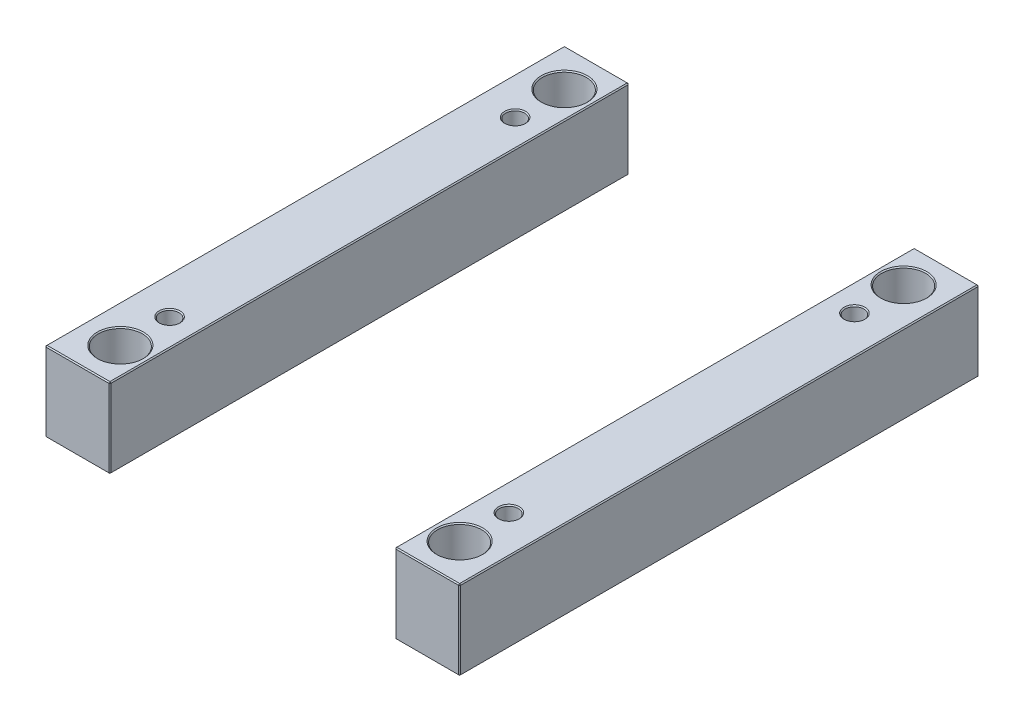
ISO-10303-21;
HEADER;
FILE_DESCRIPTION(('STEP AP214'),'2;1');
FILE_NAME('part.step','',(''),(''),'','','');
FILE_SCHEMA(('AUTOMOTIVE_DESIGN { 1 0 10303 214 1 1 1 1 }'));
ENDSEC;
DATA;
#1=APPLICATION_CONTEXT('core data for automotive mechanical design processes');
#2=APPLICATION_PROTOCOL_DEFINITION('international standard','automotive_design',2000,#1);
#3=PRODUCT_CONTEXT('',#1,'mechanical');
#4=PRODUCT('Part','Part','',(#3));
#5=PRODUCT_RELATED_PRODUCT_CATEGORY('part','',(#4));
#6=PRODUCT_DEFINITION_FORMATION('','',#4);
#7=PRODUCT_DEFINITION_CONTEXT('part definition',#1,'design');
#8=PRODUCT_DEFINITION('design','',#6,#7);
#9=PRODUCT_DEFINITION_SHAPE('','',#8);
#10=(LENGTH_UNIT() NAMED_UNIT(*) SI_UNIT(.MILLI.,.METRE.));
#11=(NAMED_UNIT(*) PLANE_ANGLE_UNIT() SI_UNIT($,.RADIAN.));
#12=(NAMED_UNIT(*) SI_UNIT($,.STERADIAN.) SOLID_ANGLE_UNIT());
#13=UNCERTAINTY_MEASURE_WITH_UNIT(LENGTH_MEASURE(1.E-05),#10,'distance_accuracy_value','');
#14=(GEOMETRIC_REPRESENTATION_CONTEXT(3) GLOBAL_UNCERTAINTY_ASSIGNED_CONTEXT((#13)) GLOBAL_UNIT_ASSIGNED_CONTEXT((#10,
#11,#12)) REPRESENTATION_CONTEXT('',''));
#15=CARTESIAN_POINT('',(0.,0.,0.));
#16=DIRECTION('',(0.,0.,1.));
#17=DIRECTION('',(1.,0.,0.));
#18=AXIS2_PLACEMENT_3D('',#15,#16,#17);
#19=CARTESIAN_POINT('',(-198.,76.,-248.));
#20=DIRECTION('',(0.,0.,1.));
#21=DIRECTION('',(1.,0.,0.));
#22=AXIS2_PLACEMENT_3D('',#19,#20,#21);
#23=PLANE('',#22);
#24=DIRECTION('',(-1.,0.,0.));
#25=VECTOR('',#24,1.);
#26=CARTESIAN_POINT('',(-198.,1.00000000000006,-248.));
#27=LINE('',#26,#25);
#28=CARTESIAN_POINT('',(-137.,1.00000000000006,-248.));
#29=VERTEX_POINT('',#28);
#30=CARTESIAN_POINT('',(-197.,1.00000000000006,-248.));
#31=VERTEX_POINT('',#30);
#32=EDGE_CURVE('P0_E137',#29,#31,#27,.T.);
#33=ORIENTED_EDGE('',*,*,#32,.T.);
#34=DIRECTION('',(0.,1.,0.));
#35=VECTOR('',#34,1.);
#36=CARTESIAN_POINT('',(-197.,76.,-248.));
#37=LINE('',#36,#35);
#38=CARTESIAN_POINT('',(-197.,75.,-248.));
#39=VERTEX_POINT('',#38);
#40=EDGE_CURVE('P0_E265',#31,#39,#37,.T.);
#41=ORIENTED_EDGE('',*,*,#40,.T.);
#42=DIRECTION('',(1.,0.,0.));
#43=VECTOR('',#42,1.);
#44=CARTESIAN_POINT('',(-198.,75.,-248.));
#45=LINE('',#44,#43);
#46=CARTESIAN_POINT('',(-137.,75.,-248.));
#47=VERTEX_POINT('',#46);
#48=EDGE_CURVE('P0_E263',#39,#47,#45,.T.);
#49=ORIENTED_EDGE('',*,*,#48,.T.);
#50=DIRECTION('',(0.,-1.,0.));
#51=VECTOR('',#50,1.);
#52=CARTESIAN_POINT('',(-137.,76.,-248.));
#53=LINE('',#52,#51);
#54=EDGE_CURVE('P0_E260',#47,#29,#53,.T.);
#55=ORIENTED_EDGE('',*,*,#54,.T.);
#56=EDGE_LOOP('',(#33,#41,#49,#55));
#57=FACE_BOUND('',#56,.T.);
#58=ADVANCED_FACE('P0_F16',(#57),#23,.F.);
#59=CARTESIAN_POINT('',(-198.,76.,248.));
#60=DIRECTION('',(1.,0.,0.));
#61=DIRECTION('',(0.,0.,-1.));
#62=AXIS2_PLACEMENT_3D('',#59,#60,#61);
#63=PLANE('',#62);
#64=DIRECTION('',(0.,1.,0.));
#65=VECTOR('',#64,1.);
#66=CARTESIAN_POINT('',(-198.,76.,247.));
#67=LINE('',#66,#65);
#68=CARTESIAN_POINT('',(-198.,1.00000000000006,247.));
#69=VERTEX_POINT('',#68);
#70=CARTESIAN_POINT('',(-198.,75.,247.));
#71=VERTEX_POINT('',#70);
#72=EDGE_CURVE('P0_E253',#69,#71,#67,.T.);
#73=ORIENTED_EDGE('',*,*,#72,.T.);
#74=DIRECTION('',(0.,0.,-1.));
#75=VECTOR('',#74,1.);
#76=CARTESIAN_POINT('',(-198.,75.,248.));
#77=LINE('',#76,#75);
#78=CARTESIAN_POINT('',(-198.,75.,-247.));
#79=VERTEX_POINT('',#78);
#80=EDGE_CURVE('P0_E258',#71,#79,#77,.T.);
#81=ORIENTED_EDGE('',*,*,#80,.T.);
#82=DIRECTION('',(0.,-1.,0.));
#83=VECTOR('',#82,1.);
#84=CARTESIAN_POINT('',(-198.,76.,-247.));
#85=LINE('',#84,#83);
#86=CARTESIAN_POINT('',(-198.,1.00000000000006,-247.));
#87=VERTEX_POINT('',#86);
#88=EDGE_CURVE('P0_E255',#79,#87,#85,.T.);
#89=ORIENTED_EDGE('',*,*,#88,.T.);
#90=DIRECTION('',(0.,0.,1.));
#91=VECTOR('',#90,1.);
#92=CARTESIAN_POINT('',(-198.,1.00000000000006,248.));
#93=LINE('',#92,#91);
#94=EDGE_CURVE('P0_E251',#87,#69,#93,.T.);
#95=ORIENTED_EDGE('',*,*,#94,.T.);
#96=EDGE_LOOP('',(#73,#81,#89,#95));
#97=FACE_BOUND('',#96,.T.);
#98=ADVANCED_FACE('P0_F333',(#97),#63,.F.);
#99=CARTESIAN_POINT('',(-198.,76.,248.));
#100=DIRECTION('',(0.,0.,-1.));
#101=DIRECTION('',(-1.,0.,0.));
#102=AXIS2_PLACEMENT_3D('',#99,#100,#101);
#103=PLANE('',#102);
#104=DIRECTION('',(-1.,0.,0.));
#105=VECTOR('',#104,1.);
#106=CARTESIAN_POINT('',(-198.,75.,248.));
#107=LINE('',#106,#105);
#108=CARTESIAN_POINT('',(-137.,75.,248.));
#109=VERTEX_POINT('',#108);
#110=CARTESIAN_POINT('',(-197.,75.,248.));
#111=VERTEX_POINT('',#110);
#112=EDGE_CURVE('P0_E272',#109,#111,#107,.T.);
#113=ORIENTED_EDGE('',*,*,#112,.T.);
#114=DIRECTION('',(0.,-1.,0.));
#115=VECTOR('',#114,1.);
#116=CARTESIAN_POINT('',(-197.,76.,248.));
#117=LINE('',#116,#115);
#118=CARTESIAN_POINT('',(-197.,1.00000000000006,248.));
#119=VERTEX_POINT('',#118);
#120=EDGE_CURVE('P0_E274',#111,#119,#117,.T.);
#121=ORIENTED_EDGE('',*,*,#120,.T.);
#122=DIRECTION('',(1.,0.,0.));
#123=VECTOR('',#122,1.);
#124=CARTESIAN_POINT('',(-136.,1.00000000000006,248.));
#125=LINE('',#124,#123);
#126=CARTESIAN_POINT('',(-137.,1.00000000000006,248.));
#127=VERTEX_POINT('',#126);
#128=EDGE_CURVE('P0_E270',#119,#127,#125,.T.);
#129=ORIENTED_EDGE('',*,*,#128,.T.);
#130=DIRECTION('',(0.,1.,0.));
#131=VECTOR('',#130,1.);
#132=CARTESIAN_POINT('',(-137.,76.,248.));
#133=LINE('',#132,#131);
#134=EDGE_CURVE('P0_E268',#127,#109,#133,.T.);
#135=ORIENTED_EDGE('',*,*,#134,.T.);
#136=EDGE_LOOP('',(#113,#121,#129,#135));
#137=FACE_BOUND('',#136,.T.);
#138=ADVANCED_FACE('P0_F372',(#137),#103,.F.);
#139=CARTESIAN_POINT('',(-136.,76.,-248.));
#140=DIRECTION('',(-1.,0.,0.));
#141=DIRECTION('',(0.,0.,1.));
#142=AXIS2_PLACEMENT_3D('',#139,#140,#141);
#143=PLANE('',#142);
#144=DIRECTION('',(0.,0.,1.));
#145=VECTOR('',#144,1.);
#146=CARTESIAN_POINT('',(-136.,75.,-248.));
#147=LINE('',#146,#145);
#148=CARTESIAN_POINT('',(-136.,75.,-247.));
#149=VERTEX_POINT('',#148);
#150=CARTESIAN_POINT('',(-136.,75.,247.));
#151=VERTEX_POINT('',#150);
#152=EDGE_CURVE('P0_E31',#149,#151,#147,.T.);
#153=ORIENTED_EDGE('',*,*,#152,.T.);
#154=DIRECTION('',(0.,-1.,0.));
#155=VECTOR('',#154,1.);
#156=CARTESIAN_POINT('',(-136.,76.,247.));
#157=LINE('',#156,#155);
#158=CARTESIAN_POINT('',(-136.,1.00000000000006,247.));
#159=VERTEX_POINT('',#158);
#160=EDGE_CURVE('P0_E190',#151,#159,#157,.T.);
#161=ORIENTED_EDGE('',*,*,#160,.T.);
#162=DIRECTION('',(0.,0.,-1.));
#163=VECTOR('',#162,1.);
#164=CARTESIAN_POINT('',(-136.,1.00000000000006,-248.));
#165=LINE('',#164,#163);
#166=CARTESIAN_POINT('',(-136.,1.00000000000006,-247.));
#167=VERTEX_POINT('',#166);
#168=EDGE_CURVE('P0_E286',#159,#167,#165,.T.);
#169=ORIENTED_EDGE('',*,*,#168,.T.);
#170=DIRECTION('',(0.,1.,0.));
#171=VECTOR('',#170,1.);
#172=CARTESIAN_POINT('',(-136.,76.,-247.));
#173=LINE('',#172,#171);
#174=EDGE_CURVE('P0_E36',#167,#149,#173,.T.);
#175=ORIENTED_EDGE('',*,*,#174,.T.);
#176=EDGE_LOOP('',(#153,#161,#169,#175));
#177=FACE_BOUND('',#176,.T.);
#178=ADVANCED_FACE('P0_F649',(#177),#143,.F.);
#179=CARTESIAN_POINT('',(0.,76.,0.));
#180=DIRECTION('',(0.,-1.,0.));
#181=DIRECTION('',(0.,0.,-1.));
#182=AXIS2_PLACEMENT_3D('',#179,#180,#181);
#183=PLANE('',#182);
#184=CARTESIAN_POINT('',(-162.,76.,-212.));
#185=DIRECTION('',(0.,-1.,0.));
#186=DIRECTION('',(0.,0.,-1.));
#187=AXIS2_PLACEMENT_3D('',#184,#185,#186);
#188=CIRCLE('',#187,22.);
#189=CARTESIAN_POINT('',(-162.,76.,-234.));
#190=VERTEX_POINT('',#189);
#191=EDGE_CURVE('P0_E214',#190,#190,#188,.T.);
#192=ORIENTED_EDGE('',*,*,#191,.T.);
#193=EDGE_LOOP('',(#192));
#194=FACE_BOUND('',#193,.T.);
#195=CARTESIAN_POINT('',(-162.,76.,212.));
#196=DIRECTION('',(0.,-1.,0.));
#197=DIRECTION('',(0.,0.,-1.));
#198=AXIS2_PLACEMENT_3D('',#195,#196,#197);
#199=CIRCLE('',#198,22.);
#200=CARTESIAN_POINT('',(-162.,76.,190.));
#201=VERTEX_POINT('',#200);
#202=EDGE_CURVE('P0_E211',#201,#201,#199,.T.);
#203=ORIENTED_EDGE('',*,*,#202,.T.);
#204=EDGE_LOOP('',(#203));
#205=FACE_BOUND('',#204,.T.);
#206=CARTESIAN_POINT('',(-162.,76.,165.));
#207=DIRECTION('',(0.,-1.,0.));
#208=DIRECTION('',(0.,0.,-1.));
#209=AXIS2_PLACEMENT_3D('',#206,#207,#208);
#210=CIRCLE('',#209,10.);
#211=CARTESIAN_POINT('',(-162.,76.,155.));
#212=VERTEX_POINT('',#211);
#213=EDGE_CURVE('P0_E193',#212,#212,#210,.T.);
#214=ORIENTED_EDGE('',*,*,#213,.T.);
#215=EDGE_LOOP('',(#214));
#216=FACE_BOUND('',#215,.T.);
#217=CARTESIAN_POINT('',(-162.,76.,-165.));
#218=DIRECTION('',(0.,-1.,0.));
#219=DIRECTION('',(0.,0.,-1.));
#220=AXIS2_PLACEMENT_3D('',#217,#218,#219);
#221=CIRCLE('',#220,10.);
#222=CARTESIAN_POINT('',(-162.,76.,-175.));
#223=VERTEX_POINT('',#222);
#224=EDGE_CURVE('P0_E189',#223,#223,#221,.T.);
#225=ORIENTED_EDGE('',*,*,#224,.T.);
#226=EDGE_LOOP('',(#225));
#227=FACE_BOUND('',#226,.T.);
#228=DIRECTION('',(0.,0.,1.));
#229=VECTOR('',#228,1.);
#230=CARTESIAN_POINT('',(-197.,76.,0.));
#231=LINE('',#230,#229);
#232=CARTESIAN_POINT('',(-197.,76.,-247.));
#233=VERTEX_POINT('',#232);
#234=CARTESIAN_POINT('',(-197.,76.,247.));
#235=VERTEX_POINT('',#234);
#236=EDGE_CURVE('P0_E281',#233,#235,#231,.T.);
#237=ORIENTED_EDGE('',*,*,#236,.T.);
#238=DIRECTION('',(1.,0.,0.));
#239=VECTOR('',#238,1.);
#240=CARTESIAN_POINT('',(0.,76.,247.));
#241=LINE('',#240,#239);
#242=CARTESIAN_POINT('',(-137.,76.,247.));
#243=VERTEX_POINT('',#242);
#244=EDGE_CURVE('P0_E283',#235,#243,#241,.T.);
#245=ORIENTED_EDGE('',*,*,#244,.T.);
#246=DIRECTION('',(0.,0.,-1.));
#247=VECTOR('',#246,1.);
#248=CARTESIAN_POINT('',(-137.,76.,0.));
#249=LINE('',#248,#247);
#250=CARTESIAN_POINT('',(-137.,76.,-247.));
#251=VERTEX_POINT('',#250);
#252=EDGE_CURVE('P0_E277',#243,#251,#249,.T.);
#253=ORIENTED_EDGE('',*,*,#252,.T.);
#254=DIRECTION('',(-1.,0.,0.));
#255=VECTOR('',#254,1.);
#256=CARTESIAN_POINT('',(0.,76.,-247.));
#257=LINE('',#256,#255);
#258=EDGE_CURVE('P0_E279',#251,#233,#257,.T.);
#259=ORIENTED_EDGE('',*,*,#258,.T.);
#260=EDGE_LOOP('',(#237,#245,#253,#259));
#261=FACE_BOUND('',#260,.T.);
#262=ADVANCED_FACE('P0_F229',(#194,#205,#216,#227,#261),#183,.F.);
#263=CARTESIAN_POINT('',(0.,0.,0.));
#264=DIRECTION('',(0.,-1.,0.));
#265=DIRECTION('',(0.,0.,-1.));
#266=AXIS2_PLACEMENT_3D('',#263,#264,#265);
#267=PLANE('',#266);
#268=CARTESIAN_POINT('',(-162.,0.,-212.));
#269=DIRECTION('',(0.,-1.,0.));
#270=DIRECTION('',(0.,0.,-1.));
#271=AXIS2_PLACEMENT_3D('',#268,#269,#270);
#272=CIRCLE('',#271,22.);
#273=CARTESIAN_POINT('',(-162.,0.,-234.));
#274=VERTEX_POINT('',#273);
#275=EDGE_CURVE('P0_E202',#274,#274,#272,.F.);
#276=ORIENTED_EDGE('',*,*,#275,.T.);
#277=EDGE_LOOP('',(#276));
#278=FACE_BOUND('',#277,.T.);
#279=CARTESIAN_POINT('',(-162.,0.,212.));
#280=DIRECTION('',(0.,-1.,0.));
#281=DIRECTION('',(0.,0.,-1.));
#282=AXIS2_PLACEMENT_3D('',#279,#280,#281);
#283=CIRCLE('',#282,22.);
#284=CARTESIAN_POINT('',(-162.,0.,190.));
#285=VERTEX_POINT('',#284);
#286=EDGE_CURVE('P0_E199',#285,#285,#283,.F.);
#287=ORIENTED_EDGE('',*,*,#286,.T.);
#288=EDGE_LOOP('',(#287));
#289=FACE_BOUND('',#288,.T.);
#290=CARTESIAN_POINT('',(-162.,0.,-165.));
#291=DIRECTION('',(0.,-1.,0.));
#292=DIRECTION('',(0.,0.,-1.));
#293=AXIS2_PLACEMENT_3D('',#290,#291,#292);
#294=CIRCLE('',#293,10.);
#295=CARTESIAN_POINT('',(-162.,0.,-175.));
#296=VERTEX_POINT('',#295);
#297=EDGE_CURVE('P0_E235',#296,#296,#294,.F.);
#298=ORIENTED_EDGE('',*,*,#297,.T.);
#299=EDGE_LOOP('',(#298));
#300=FACE_BOUND('',#299,.T.);
#301=CARTESIAN_POINT('',(-162.,0.,165.));
#302=DIRECTION('',(0.,-1.,0.));
#303=DIRECTION('',(0.,0.,-1.));
#304=AXIS2_PLACEMENT_3D('',#301,#302,#303);
#305=CIRCLE('',#304,10.);
#306=CARTESIAN_POINT('',(-162.,0.,155.));
#307=VERTEX_POINT('',#306);
#308=EDGE_CURVE('P0_E238',#307,#307,#305,.F.);
#309=ORIENTED_EDGE('',*,*,#308,.T.);
#310=EDGE_LOOP('',(#309));
#311=FACE_BOUND('',#310,.T.);
#312=DIRECTION('',(-1.,0.,0.));
#313=VECTOR('',#312,1.);
#314=CARTESIAN_POINT('',(-198.,0.,247.));
#315=LINE('',#314,#313);
#316=CARTESIAN_POINT('',(-137.,0.,247.));
#317=VERTEX_POINT('',#316);
#318=CARTESIAN_POINT('',(-197.,0.,247.));
#319=VERTEX_POINT('',#318);
#320=EDGE_CURVE('P0_E114',#317,#319,#315,.T.);
#321=ORIENTED_EDGE('',*,*,#320,.T.);
#322=DIRECTION('',(0.,0.,-1.));
#323=VECTOR('',#322,1.);
#324=CARTESIAN_POINT('',(-197.,0.,-248.));
#325=LINE('',#324,#323);
#326=CARTESIAN_POINT('',(-197.,0.,-247.));
#327=VERTEX_POINT('',#326);
#328=EDGE_CURVE('P0_E110',#319,#327,#325,.T.);
#329=ORIENTED_EDGE('',*,*,#328,.T.);
#330=DIRECTION('',(1.,0.,0.));
#331=VECTOR('',#330,1.);
#332=CARTESIAN_POINT('',(-136.,0.,-247.));
#333=LINE('',#332,#331);
#334=CARTESIAN_POINT('',(-137.,0.,-247.));
#335=VERTEX_POINT('',#334);
#336=EDGE_CURVE('P0_E104',#327,#335,#333,.T.);
#337=ORIENTED_EDGE('',*,*,#336,.T.);
#338=DIRECTION('',(0.,0.,1.));
#339=VECTOR('',#338,1.);
#340=CARTESIAN_POINT('',(-137.,0.,248.));
#341=LINE('',#340,#339);
#342=EDGE_CURVE('P0_E107',#335,#317,#341,.T.);
#343=ORIENTED_EDGE('',*,*,#342,.T.);
#344=EDGE_LOOP('',(#321,#329,#337,#343));
#345=FACE_BOUND('',#344,.T.);
#346=ADVANCED_FACE('P0_F106',(#278,#289,#300,#311,#345),#267,.T.);
#347=CARTESIAN_POINT('',(-162.,0.,-165.));
#348=DIRECTION('',(0.,1.,0.));
#349=DIRECTION('',(0.,0.,1.));
#350=AXIS2_PLACEMENT_3D('',#347,#348,#349);
#351=CYLINDRICAL_SURFACE('',#350,9.);
#352=CARTESIAN_POINT('',(-162.,75.,-165.));
#353=DIRECTION('',(0.,-1.,0.));
#354=DIRECTION('',(0.,0.,-1.));
#355=AXIS2_PLACEMENT_3D('',#352,#353,#354);
#356=CIRCLE('',#355,9.);
#357=CARTESIAN_POINT('',(-162.,75.,-174.));
#358=VERTEX_POINT('',#357);
#359=EDGE_CURVE('P0_E196',#358,#358,#356,.F.);
#360=ORIENTED_EDGE('',*,*,#359,.T.);
#361=EDGE_LOOP('',(#360));
#362=FACE_BOUND('',#361,.T.);
#363=CARTESIAN_POINT('',(-162.,0.999999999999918,-165.));
#364=DIRECTION('',(0.,-1.,0.));
#365=DIRECTION('',(0.,0.,-1.));
#366=AXIS2_PLACEMENT_3D('',#363,#364,#365);
#367=CIRCLE('',#366,9.);
#368=CARTESIAN_POINT('',(-162.,0.999999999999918,-174.));
#369=VERTEX_POINT('',#368);
#370=EDGE_CURVE('P0_E241',#369,#369,#367,.T.);
#371=ORIENTED_EDGE('',*,*,#370,.T.);
#372=EDGE_LOOP('',(#371));
#373=FACE_BOUND('',#372,.T.);
#374=ADVANCED_FACE('P0_F228',(#362,#373),#351,.F.);
#375=CARTESIAN_POINT('',(-162.,0.,165.));
#376=DIRECTION('',(0.,1.,0.));
#377=DIRECTION('',(0.,0.,1.));
#378=AXIS2_PLACEMENT_3D('',#375,#376,#377);
#379=CYLINDRICAL_SURFACE('',#378,9.);
#380=CARTESIAN_POINT('',(-162.,75.,165.));
#381=DIRECTION('',(0.,-1.,0.));
#382=DIRECTION('',(0.,0.,-1.));
#383=AXIS2_PLACEMENT_3D('',#380,#381,#382);
#384=CIRCLE('',#383,9.);
#385=CARTESIAN_POINT('',(-162.,75.,156.));
#386=VERTEX_POINT('',#385);
#387=EDGE_CURVE('P0_E186',#386,#386,#384,.F.);
#388=ORIENTED_EDGE('',*,*,#387,.T.);
#389=EDGE_LOOP('',(#388));
#390=FACE_BOUND('',#389,.T.);
#391=CARTESIAN_POINT('',(-162.,0.999999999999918,165.));
#392=DIRECTION('',(0.,-1.,0.));
#393=DIRECTION('',(0.,0.,-1.));
#394=AXIS2_PLACEMENT_3D('',#391,#392,#393);
#395=CIRCLE('',#394,9.);
#396=CARTESIAN_POINT('',(-162.,0.999999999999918,156.));
#397=VERTEX_POINT('',#396);
#398=EDGE_CURVE('P0_E248',#397,#397,#395,.T.);
#399=ORIENTED_EDGE('',*,*,#398,.T.);
#400=EDGE_LOOP('',(#399));
#401=FACE_BOUND('',#400,.T.);
#402=ADVANCED_FACE('P0_F380',(#390,#401),#379,.F.);
#403=CARTESIAN_POINT('',(-162.,0.,-165.));
#404=DIRECTION('',(0.,-1.,0.));
#405=DIRECTION('',(0.,0.,-1.));
#406=AXIS2_PLACEMENT_3D('',#403,#404,#405);
#407=CONICAL_SURFACE('',#406,10.,0.785398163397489);
#408=ORIENTED_EDGE('',*,*,#370,.F.);
#409=EDGE_LOOP('',(#408));
#410=FACE_BOUND('',#409,.T.);
#411=ORIENTED_EDGE('',*,*,#297,.F.);
#412=EDGE_LOOP('',(#411));
#413=FACE_BOUND('',#412,.T.);
#414=ADVANCED_FACE('P0_F376',(#410,#413),#407,.F.);
#415=CARTESIAN_POINT('',(-162.,0.,165.));
#416=DIRECTION('',(0.,-1.,0.));
#417=DIRECTION('',(0.,0.,-1.));
#418=AXIS2_PLACEMENT_3D('',#415,#416,#417);
#419=CONICAL_SURFACE('',#418,10.,0.785398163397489);
#420=ORIENTED_EDGE('',*,*,#398,.F.);
#421=EDGE_LOOP('',(#420));
#422=FACE_BOUND('',#421,.T.);
#423=ORIENTED_EDGE('',*,*,#308,.F.);
#424=EDGE_LOOP('',(#423));
#425=FACE_BOUND('',#424,.T.);
#426=ADVANCED_FACE('P0_F379',(#422,#425),#419,.F.);
#427=CARTESIAN_POINT('',(-136.,76.,247.));
#428=DIRECTION('',(-0.707106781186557,0.,-0.707106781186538));
#429=DIRECTION('',(0.,-1.,0.));
#430=AXIS2_PLACEMENT_3D('',#427,#428,#429);
#431=PLANE('',#430);
#432=DIRECTION('',(-0.707106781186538,0.,0.707106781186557));
#433=VECTOR('',#432,1.);
#434=CARTESIAN_POINT('',(-136.5,75.,247.5));
#435=LINE('',#434,#433);
#436=EDGE_CURVE('P0_E125',#109,#151,#435,.F.);
#437=ORIENTED_EDGE('',*,*,#436,.F.);
#438=ORIENTED_EDGE('',*,*,#134,.F.);
#439=DIRECTION('',(0.707106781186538,0.,-0.707106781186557));
#440=VECTOR('',#439,1.);
#441=CARTESIAN_POINT('',(-137.,1.00000000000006,248.));
#442=LINE('',#441,#440);
#443=EDGE_CURVE('P0_E181',#159,#127,#442,.F.);
#444=ORIENTED_EDGE('',*,*,#443,.F.);
#445=ORIENTED_EDGE('',*,*,#160,.F.);
#446=EDGE_LOOP('',(#437,#438,#444,#445));
#447=FACE_BOUND('',#446,.T.);
#448=ADVANCED_FACE('P0_F384',(#447),#431,.F.);
#449=CARTESIAN_POINT('',(-137.,76.,247.));
#450=DIRECTION('',(0.577350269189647,0.577350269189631,0.577350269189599));
#451=DIRECTION('',(-0.707106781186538,0.707106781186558,0.));
#452=AXIS2_PLACEMENT_3D('',#449,#450,#451);
#453=PLANE('',#452);
#454=DIRECTION('',(0.,0.707106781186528,-0.707106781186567));
#455=VECTOR('',#454,1.);
#456=CARTESIAN_POINT('',(-137.,76.,247.));
#457=LINE('',#456,#455);
#458=EDGE_CURVE('P0_E175',#109,#243,#457,.T.);
#459=ORIENTED_EDGE('',*,*,#458,.F.);
#460=ORIENTED_EDGE('',*,*,#436,.T.);
#461=DIRECTION('',(0.707106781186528,-0.707106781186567,0.));
#462=VECTOR('',#461,1.);
#463=CARTESIAN_POINT('',(-137.,76.,247.));
#464=LINE('',#463,#462);
#465=EDGE_CURVE('P0_E178',#243,#151,#464,.T.);
#466=ORIENTED_EDGE('',*,*,#465,.F.);
#467=EDGE_LOOP('',(#459,#460,#466));
#468=FACE_BOUND('',#467,.T.);
#469=ADVANCED_FACE('P0_F588',(#468),#453,.T.);
#470=CARTESIAN_POINT('',(-137.,1.00000000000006,248.));
#471=DIRECTION('',(0.577350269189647,-0.577350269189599,0.577350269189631));
#472=DIRECTION('',(0.707106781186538,0.,-0.707106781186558));
#473=AXIS2_PLACEMENT_3D('',#470,#471,#472);
#474=PLANE('',#473);
#475=DIRECTION('',(0.707106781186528,0.707106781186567,0.));
#476=VECTOR('',#475,1.);
#477=CARTESIAN_POINT('',(-136.5,0.500000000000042,247.));
#478=LINE('',#477,#476);
#479=EDGE_CURVE('P0_E123',#159,#317,#478,.F.);
#480=ORIENTED_EDGE('',*,*,#479,.F.);
#481=ORIENTED_EDGE('',*,*,#443,.T.);
#482=DIRECTION('',(0.,-0.707106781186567,-0.707106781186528));
#483=VECTOR('',#482,1.);
#484=CARTESIAN_POINT('',(-137.,1.00000000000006,248.));
#485=LINE('',#484,#483);
#486=EDGE_CURVE('P0_E172',#317,#127,#485,.F.);
#487=ORIENTED_EDGE('',*,*,#486,.F.);
#488=EDGE_LOOP('',(#480,#481,#487));
#489=FACE_BOUND('',#488,.T.);
#490=ADVANCED_FACE('P0_F597',(#489),#474,.T.);
#491=CARTESIAN_POINT('',(-137.,76.,0.));
#492=DIRECTION('',(-0.707106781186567,-0.707106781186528,0.));
#493=DIRECTION('',(0.,0.,-1.));
#494=AXIS2_PLACEMENT_3D('',#491,#492,#493);
#495=PLANE('',#494);
#496=ORIENTED_EDGE('',*,*,#465,.T.);
#497=ORIENTED_EDGE('',*,*,#152,.F.);
#498=DIRECTION('',(-0.707106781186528,0.707106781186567,0.));
#499=VECTOR('',#498,1.);
#500=CARTESIAN_POINT('',(-136.5,75.5,-247.));
#501=LINE('',#500,#499);
#502=EDGE_CURVE('P0_E165',#251,#149,#501,.F.);
#503=ORIENTED_EDGE('',*,*,#502,.F.);
#504=ORIENTED_EDGE('',*,*,#252,.F.);
#505=EDGE_LOOP('',(#496,#497,#503,#504));
#506=FACE_BOUND('',#505,.T.);
#507=ADVANCED_FACE('P0_F349',(#506),#495,.F.);
#508=CARTESIAN_POINT('',(0.,76.,247.));
#509=DIRECTION('',(0.,-0.707106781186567,-0.707106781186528));
#510=DIRECTION('',(1.,0.,0.));
#511=AXIS2_PLACEMENT_3D('',#508,#509,#510);
#512=PLANE('',#511);
#513=ORIENTED_EDGE('',*,*,#458,.T.);
#514=ORIENTED_EDGE('',*,*,#244,.F.);
#515=DIRECTION('',(0.,-0.707106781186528,0.707106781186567));
#516=VECTOR('',#515,1.);
#517=CARTESIAN_POINT('',(-197.,75.5,247.5));
#518=LINE('',#517,#516);
#519=EDGE_CURVE('P0_E162',#111,#235,#518,.F.);
#520=ORIENTED_EDGE('',*,*,#519,.F.);
#521=ORIENTED_EDGE('',*,*,#112,.F.);
#522=EDGE_LOOP('',(#513,#514,#520,#521));
#523=FACE_BOUND('',#522,.T.);
#524=ADVANCED_FACE('P0_F344',(#523),#512,.F.);
#525=CARTESIAN_POINT('',(-197.,76.,248.));
#526=DIRECTION('',(0.707106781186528,0.,-0.707106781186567));
#527=DIRECTION('',(0.,-1.,0.));
#528=AXIS2_PLACEMENT_3D('',#525,#526,#527);
#529=PLANE('',#528);
#530=DIRECTION('',(0.707106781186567,0.,0.707106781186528));
#531=VECTOR('',#530,1.);
#532=CARTESIAN_POINT('',(-197.,1.00000000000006,248.));
#533=LINE('',#532,#531);
#534=EDGE_CURVE('P0_E156',#119,#69,#533,.F.);
#535=ORIENTED_EDGE('',*,*,#534,.F.);
#536=ORIENTED_EDGE('',*,*,#120,.F.);
#537=DIRECTION('',(-0.707106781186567,0.,-0.707106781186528));
#538=VECTOR('',#537,1.);
#539=CARTESIAN_POINT('',(-198.,75.,247.));
#540=LINE('',#539,#538);
#541=EDGE_CURVE('P0_E159',#71,#111,#540,.F.);
#542=ORIENTED_EDGE('',*,*,#541,.F.);
#543=ORIENTED_EDGE('',*,*,#72,.F.);
#544=EDGE_LOOP('',(#535,#536,#542,#543));
#545=FACE_BOUND('',#544,.T.);
#546=ADVANCED_FACE('P0_F338',(#545),#529,.F.);
#547=CARTESIAN_POINT('',(-198.,1.00000000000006,248.));
#548=DIRECTION('',(0.,-0.707106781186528,0.707106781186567));
#549=DIRECTION('',(-1.,0.,0.));
#550=AXIS2_PLACEMENT_3D('',#547,#548,#549);
#551=PLANE('',#550);
#552=ORIENTED_EDGE('',*,*,#486,.T.);
#553=ORIENTED_EDGE('',*,*,#128,.F.);
#554=DIRECTION('',(0.,0.707106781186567,0.707106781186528));
#555=VECTOR('',#554,1.);
#556=CARTESIAN_POINT('',(-197.,1.00000000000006,248.));
#557=LINE('',#556,#555);
#558=EDGE_CURVE('P0_E134',#319,#119,#557,.T.);
#559=ORIENTED_EDGE('',*,*,#558,.F.);
#560=ORIENTED_EDGE('',*,*,#320,.F.);
#561=EDGE_LOOP('',(#552,#553,#559,#560));
#562=FACE_BOUND('',#561,.T.);
#563=ADVANCED_FACE('P0_F364',(#562),#551,.T.);
#564=CARTESIAN_POINT('',(-136.,1.00000000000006,-248.));
#565=DIRECTION('',(0.707106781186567,-0.707106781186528,0.));
#566=DIRECTION('',(0.,0.,1.));
#567=AXIS2_PLACEMENT_3D('',#564,#565,#566);
#568=PLANE('',#567);
#569=ORIENTED_EDGE('',*,*,#479,.T.);
#570=ORIENTED_EDGE('',*,*,#342,.F.);
#571=DIRECTION('',(-0.707106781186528,-0.707106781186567,0.));
#572=VECTOR('',#571,1.);
#573=CARTESIAN_POINT('',(-137.,0.,-247.));
#574=LINE('',#573,#572);
#575=EDGE_CURVE('P0_E120',#167,#335,#574,.T.);
#576=ORIENTED_EDGE('',*,*,#575,.F.);
#577=ORIENTED_EDGE('',*,*,#168,.F.);
#578=EDGE_LOOP('',(#569,#570,#576,#577));
#579=FACE_BOUND('',#578,.T.);
#580=ADVANCED_FACE('P0_F119',(#579),#568,.T.);
#581=CARTESIAN_POINT('',(-137.,76.,-248.));
#582=DIRECTION('',(-0.707106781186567,0.,0.707106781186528));
#583=DIRECTION('',(0.,-1.,0.));
#584=AXIS2_PLACEMENT_3D('',#581,#582,#583);
#585=PLANE('',#584);
#586=DIRECTION('',(0.707106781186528,0.,0.707106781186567));
#587=VECTOR('',#586,1.);
#588=CARTESIAN_POINT('',(-137.,75.,-248.));
#589=LINE('',#588,#587);
#590=EDGE_CURVE('P0_E168',#149,#47,#589,.F.);
#591=ORIENTED_EDGE('',*,*,#590,.F.);
#592=ORIENTED_EDGE('',*,*,#174,.F.);
#593=DIRECTION('',(-0.707106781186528,0.,-0.707106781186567));
#594=VECTOR('',#593,1.);
#595=CARTESIAN_POINT('',(-136.5,1.00000000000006,-247.5));
#596=LINE('',#595,#594);
#597=EDGE_CURVE('P0_E133',#29,#167,#596,.F.);
#598=ORIENTED_EDGE('',*,*,#597,.F.);
#599=ORIENTED_EDGE('',*,*,#54,.F.);
#600=EDGE_LOOP('',(#591,#592,#598,#599));
#601=FACE_BOUND('',#600,.T.);
#602=ADVANCED_FACE('P0_F354',(#601),#585,.F.);
#603=CARTESIAN_POINT('',(-137.,75.,-248.));
#604=DIRECTION('',(0.577350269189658,0.577350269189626,-0.577350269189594));
#605=DIRECTION('',(-0.707106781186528,0.707106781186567,0.));
#606=AXIS2_PLACEMENT_3D('',#603,#604,#605);
#607=PLANE('',#606);
#608=ORIENTED_EDGE('',*,*,#502,.T.);
#609=ORIENTED_EDGE('',*,*,#590,.T.);
#610=DIRECTION('',(0.,-0.707106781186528,-0.707106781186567));
#611=VECTOR('',#610,1.);
#612=CARTESIAN_POINT('',(-137.,75.,-248.));
#613=LINE('',#612,#611);
#614=EDGE_CURVE('P0_E151',#251,#47,#613,.T.);
#615=ORIENTED_EDGE('',*,*,#614,.F.);
#616=EDGE_LOOP('',(#608,#609,#615));
#617=FACE_BOUND('',#616,.T.);
#618=ADVANCED_FACE('P0_F352',(#617),#607,.T.);
#619=CARTESIAN_POINT('',(-198.,75.,247.));
#620=DIRECTION('',(-0.577350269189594,0.577350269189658,0.577350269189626));
#621=DIRECTION('',(0.,-0.707106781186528,0.707106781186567));
#622=AXIS2_PLACEMENT_3D('',#619,#620,#621);
#623=PLANE('',#622);
#624=ORIENTED_EDGE('',*,*,#541,.T.);
#625=ORIENTED_EDGE('',*,*,#519,.T.);
#626=DIRECTION('',(0.707106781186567,0.707106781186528,0.));
#627=VECTOR('',#626,1.);
#628=CARTESIAN_POINT('',(-198.,75.,247.));
#629=LINE('',#628,#627);
#630=EDGE_CURVE('P0_E142',#71,#235,#629,.T.);
#631=ORIENTED_EDGE('',*,*,#630,.F.);
#632=EDGE_LOOP('',(#624,#625,#631));
#633=FACE_BOUND('',#632,.T.);
#634=ADVANCED_FACE('P0_F341',(#633),#623,.T.);
#635=CARTESIAN_POINT('',(-197.,1.00000000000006,248.));
#636=DIRECTION('',(-0.577350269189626,-0.577350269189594,0.577350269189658));
#637=DIRECTION('',(0.707106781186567,0.,0.707106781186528));
#638=AXIS2_PLACEMENT_3D('',#635,#636,#637);
#639=PLANE('',#638);
#640=ORIENTED_EDGE('',*,*,#558,.T.);
#641=ORIENTED_EDGE('',*,*,#534,.T.);
#642=DIRECTION('',(0.707106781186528,-0.707106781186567,0.));
#643=VECTOR('',#642,1.);
#644=CARTESIAN_POINT('',(-197.5,0.500000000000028,247.));
#645=LINE('',#644,#643);
#646=EDGE_CURVE('P0_E138',#319,#69,#645,.F.);
#647=ORIENTED_EDGE('',*,*,#646,.F.);
#648=EDGE_LOOP('',(#640,#641,#647));
#649=FACE_BOUND('',#648,.T.);
#650=ADVANCED_FACE('P0_F403',(#649),#639,.T.);
#651=CARTESIAN_POINT('',(-137.,0.,-247.));
#652=DIRECTION('',(0.577350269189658,-0.577350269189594,-0.577350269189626));
#653=DIRECTION('',(-0.707106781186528,0.,-0.707106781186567));
#654=AXIS2_PLACEMENT_3D('',#651,#652,#653);
#655=PLANE('',#654);
#656=ORIENTED_EDGE('',*,*,#597,.T.);
#657=ORIENTED_EDGE('',*,*,#575,.T.);
#658=DIRECTION('',(0.,0.707106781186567,-0.707106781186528));
#659=VECTOR('',#658,1.);
#660=CARTESIAN_POINT('',(-137.,0.,-247.));
#661=LINE('',#660,#659);
#662=EDGE_CURVE('P0_E130',#29,#335,#661,.F.);
#663=ORIENTED_EDGE('',*,*,#662,.F.);
#664=EDGE_LOOP('',(#656,#657,#663));
#665=FACE_BOUND('',#664,.T.);
#666=ADVANCED_FACE('P0_F129',(#665),#655,.T.);
#667=CARTESIAN_POINT('',(0.,76.,-247.));
#668=DIRECTION('',(0.,-0.707106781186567,0.707106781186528));
#669=DIRECTION('',(-1.,0.,0.));
#670=AXIS2_PLACEMENT_3D('',#667,#668,#669);
#671=PLANE('',#670);
#672=ORIENTED_EDGE('',*,*,#614,.T.);
#673=ORIENTED_EDGE('',*,*,#48,.F.);
#674=DIRECTION('',(0.,0.707106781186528,0.707106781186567));
#675=VECTOR('',#674,1.);
#676=CARTESIAN_POINT('',(-197.,75.,-248.));
#677=LINE('',#676,#675);
#678=EDGE_CURVE('P0_E139',#233,#39,#677,.F.);
#679=ORIENTED_EDGE('',*,*,#678,.F.);
#680=ORIENTED_EDGE('',*,*,#258,.F.);
#681=EDGE_LOOP('',(#672,#673,#679,#680));
#682=FACE_BOUND('',#681,.T.);
#683=ADVANCED_FACE('P0_F316',(#682),#671,.F.);
#684=CARTESIAN_POINT('',(-197.,76.,0.));
#685=DIRECTION('',(0.707106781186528,-0.707106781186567,0.));
#686=DIRECTION('',(0.,0.,1.));
#687=AXIS2_PLACEMENT_3D('',#684,#685,#686);
#688=PLANE('',#687);
#689=ORIENTED_EDGE('',*,*,#630,.T.);
#690=ORIENTED_EDGE('',*,*,#236,.F.);
#691=DIRECTION('',(-0.707106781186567,-0.707106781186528,0.));
#692=VECTOR('',#691,1.);
#693=CARTESIAN_POINT('',(-197.5,75.5,-247.));
#694=LINE('',#693,#692);
#695=EDGE_CURVE('P0_E145',#79,#233,#694,.F.);
#696=ORIENTED_EDGE('',*,*,#695,.F.);
#697=ORIENTED_EDGE('',*,*,#80,.F.);
#698=EDGE_LOOP('',(#689,#690,#696,#697));
#699=FACE_BOUND('',#698,.T.);
#700=ADVANCED_FACE('P0_F310',(#699),#688,.F.);
#701=CARTESIAN_POINT('',(-198.,1.00000000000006,248.));
#702=DIRECTION('',(-0.707106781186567,-0.707106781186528,0.));
#703=DIRECTION('',(0.,0.,-1.));
#704=AXIS2_PLACEMENT_3D('',#701,#702,#703);
#705=PLANE('',#704);
#706=ORIENTED_EDGE('',*,*,#646,.T.);
#707=ORIENTED_EDGE('',*,*,#94,.F.);
#708=DIRECTION('',(-0.707106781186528,0.707106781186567,0.));
#709=VECTOR('',#708,1.);
#710=CARTESIAN_POINT('',(-198.,1.00000000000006,-247.));
#711=LINE('',#710,#709);
#712=EDGE_CURVE('P0_E297',#327,#87,#711,.T.);
#713=ORIENTED_EDGE('',*,*,#712,.F.);
#714=ORIENTED_EDGE('',*,*,#328,.F.);
#715=EDGE_LOOP('',(#706,#707,#713,#714));
#716=FACE_BOUND('',#715,.T.);
#717=ADVANCED_FACE('P0_F329',(#716),#705,.T.);
#718=CARTESIAN_POINT('',(-198.,1.00000000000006,-248.));
#719=DIRECTION('',(0.,-0.707106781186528,-0.707106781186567));
#720=DIRECTION('',(1.,0.,0.));
#721=AXIS2_PLACEMENT_3D('',#718,#719,#720);
#722=PLANE('',#721);
#723=ORIENTED_EDGE('',*,*,#662,.T.);
#724=ORIENTED_EDGE('',*,*,#336,.F.);
#725=DIRECTION('',(0.,-0.707106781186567,0.707106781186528));
#726=VECTOR('',#725,1.);
#727=CARTESIAN_POINT('',(-197.,0.500000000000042,-247.5));
#728=LINE('',#727,#726);
#729=EDGE_CURVE('P0_E295',#31,#327,#728,.T.);
#730=ORIENTED_EDGE('',*,*,#729,.F.);
#731=ORIENTED_EDGE('',*,*,#32,.F.);
#732=EDGE_LOOP('',(#723,#724,#730,#731));
#733=FACE_BOUND('',#732,.T.);
#734=ADVANCED_FACE('P0_F136',(#733),#722,.T.);
#735=CARTESIAN_POINT('',(-197.,75.,-248.));
#736=DIRECTION('',(-0.577350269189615,0.577350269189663,-0.577350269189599));
#737=DIRECTION('',(-0.707106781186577,-0.707106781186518,0.));
#738=AXIS2_PLACEMENT_3D('',#735,#736,#737);
#739=PLANE('',#738);
#740=ORIENTED_EDGE('',*,*,#695,.T.);
#741=ORIENTED_EDGE('',*,*,#678,.T.);
#742=DIRECTION('',(0.707106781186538,0.,-0.707106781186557));
#743=VECTOR('',#742,1.);
#744=CARTESIAN_POINT('',(-197.,75.,-248.));
#745=LINE('',#744,#743);
#746=EDGE_CURVE('P0_E293',#79,#39,#745,.T.);
#747=ORIENTED_EDGE('',*,*,#746,.F.);
#748=EDGE_LOOP('',(#740,#741,#747));
#749=FACE_BOUND('',#748,.T.);
#750=ADVANCED_FACE('P0_F303',(#749),#739,.T.);
#751=CARTESIAN_POINT('',(-198.,1.00000000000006,-247.));
#752=DIRECTION('',(-0.577350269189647,-0.577350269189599,-0.577350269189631));
#753=DIRECTION('',(-0.707106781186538,0.,0.707106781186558));
#754=AXIS2_PLACEMENT_3D('',#751,#752,#753);
#755=PLANE('',#754);
#756=ORIENTED_EDGE('',*,*,#729,.T.);
#757=ORIENTED_EDGE('',*,*,#712,.T.);
#758=DIRECTION('',(-0.707106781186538,0.,0.707106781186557));
#759=VECTOR('',#758,1.);
#760=CARTESIAN_POINT('',(-198.,1.00000000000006,-247.));
#761=LINE('',#760,#759);
#762=EDGE_CURVE('P0_E291',#31,#87,#761,.T.);
#763=ORIENTED_EDGE('',*,*,#762,.F.);
#764=EDGE_LOOP('',(#756,#757,#763));
#765=FACE_BOUND('',#764,.T.);
#766=ADVANCED_FACE('P0_F325',(#765),#755,.T.);
#767=CARTESIAN_POINT('',(-198.,76.,-247.));
#768=DIRECTION('',(0.707106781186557,0.,0.707106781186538));
#769=DIRECTION('',(0.,-1.,0.));
#770=AXIS2_PLACEMENT_3D('',#767,#768,#769);
#771=PLANE('',#770);
#772=ORIENTED_EDGE('',*,*,#746,.T.);
#773=ORIENTED_EDGE('',*,*,#40,.F.);
#774=ORIENTED_EDGE('',*,*,#762,.T.);
#775=ORIENTED_EDGE('',*,*,#88,.F.);
#776=EDGE_LOOP('',(#772,#773,#774,#775));
#777=FACE_BOUND('',#776,.T.);
#778=ADVANCED_FACE('P0_F323',(#777),#771,.F.);
#779=CARTESIAN_POINT('',(-162.,75.,165.));
#780=DIRECTION('',(0.,1.,0.));
#781=DIRECTION('',(0.,0.,1.));
#782=AXIS2_PLACEMENT_3D('',#779,#780,#781);
#783=CONICAL_SURFACE('',#782,9.,0.785398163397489);
#784=ORIENTED_EDGE('',*,*,#213,.F.);
#785=EDGE_LOOP('',(#784));
#786=FACE_BOUND('',#785,.T.);
#787=ORIENTED_EDGE('',*,*,#387,.F.);
#788=EDGE_LOOP('',(#787));
#789=FACE_BOUND('',#788,.T.);
#790=ADVANCED_FACE('P0_F388',(#786,#789),#783,.F.);
#791=CARTESIAN_POINT('',(-162.,75.,-165.));
#792=DIRECTION('',(0.,1.,0.));
#793=DIRECTION('',(0.,0.,1.));
#794=AXIS2_PLACEMENT_3D('',#791,#792,#793);
#795=CONICAL_SURFACE('',#794,9.,0.785398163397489);
#796=ORIENTED_EDGE('',*,*,#224,.F.);
#797=EDGE_LOOP('',(#796));
#798=FACE_BOUND('',#797,.T.);
#799=ORIENTED_EDGE('',*,*,#359,.F.);
#800=EDGE_LOOP('',(#799));
#801=FACE_BOUND('',#800,.T.);
#802=ADVANCED_FACE('P0_F470',(#798,#801),#795,.F.);
#803=CARTESIAN_POINT('',(-162.,0.,212.));
#804=DIRECTION('',(0.,1.,0.));
#805=DIRECTION('',(0.,0.,1.));
#806=AXIS2_PLACEMENT_3D('',#803,#804,#805);
#807=CYLINDRICAL_SURFACE('',#806,21.);
#808=CARTESIAN_POINT('',(-162.,75.,212.));
#809=DIRECTION('',(0.,-1.,0.));
#810=DIRECTION('',(0.,0.,-1.));
#811=AXIS2_PLACEMENT_3D('',#808,#809,#810);
#812=CIRCLE('',#811,21.);
#813=CARTESIAN_POINT('',(-162.,75.,191.));
#814=VERTEX_POINT('',#813);
#815=EDGE_CURVE('P0_E10',#814,#814,#812,.F.);
#816=ORIENTED_EDGE('',*,*,#815,.T.);
#817=EDGE_LOOP('',(#816));
#818=FACE_BOUND('',#817,.T.);
#819=CARTESIAN_POINT('',(-162.,0.999999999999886,212.));
#820=DIRECTION('',(0.,-1.,0.));
#821=DIRECTION('',(0.,0.,-1.));
#822=AXIS2_PLACEMENT_3D('',#819,#820,#821);
#823=CIRCLE('',#822,21.);
#824=CARTESIAN_POINT('',(-162.,0.999999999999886,191.));
#825=VERTEX_POINT('',#824);
#826=EDGE_CURVE('P0_E24',#825,#825,#823,.T.);
#827=ORIENTED_EDGE('',*,*,#826,.T.);
#828=EDGE_LOOP('',(#827));
#829=FACE_BOUND('',#828,.T.);
#830=ADVANCED_FACE('P0_F219',(#818,#829),#807,.F.);
#831=CARTESIAN_POINT('',(-162.,0.,-212.));
#832=DIRECTION('',(0.,1.,0.));
#833=DIRECTION('',(0.,0.,1.));
#834=AXIS2_PLACEMENT_3D('',#831,#832,#833);
#835=CYLINDRICAL_SURFACE('',#834,21.);
#836=CARTESIAN_POINT('',(-162.,0.999999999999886,-212.));
#837=DIRECTION('',(0.,-1.,0.));
#838=DIRECTION('',(0.,0.,-1.));
#839=AXIS2_PLACEMENT_3D('',#836,#837,#838);
#840=CIRCLE('',#839,21.);
#841=CARTESIAN_POINT('',(-162.,0.999999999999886,-233.));
#842=VERTEX_POINT('',#841);
#843=EDGE_CURVE('P0_E208',#842,#842,#840,.T.);
#844=ORIENTED_EDGE('',*,*,#843,.T.);
#845=EDGE_LOOP('',(#844));
#846=FACE_BOUND('',#845,.T.);
#847=CARTESIAN_POINT('',(-162.,75.,-212.));
#848=DIRECTION('',(0.,-1.,0.));
#849=DIRECTION('',(0.,0.,-1.));
#850=AXIS2_PLACEMENT_3D('',#847,#848,#849);
#851=CIRCLE('',#850,21.);
#852=CARTESIAN_POINT('',(-162.,75.,-233.));
#853=VERTEX_POINT('',#852);
#854=EDGE_CURVE('P0_E205',#853,#853,#851,.F.);
#855=ORIENTED_EDGE('',*,*,#854,.T.);
#856=EDGE_LOOP('',(#855));
#857=FACE_BOUND('',#856,.T.);
#858=ADVANCED_FACE('P0_F487',(#846,#857),#835,.F.);
#859=CARTESIAN_POINT('',(-162.,0.,-212.));
#860=DIRECTION('',(0.,-1.,0.));
#861=DIRECTION('',(0.,0.,-1.));
#862=AXIS2_PLACEMENT_3D('',#859,#860,#861);
#863=CONICAL_SURFACE('',#862,22.,0.785398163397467);
#864=ORIENTED_EDGE('',*,*,#843,.F.);
#865=EDGE_LOOP('',(#864));
#866=FACE_BOUND('',#865,.T.);
#867=ORIENTED_EDGE('',*,*,#275,.F.);
#868=EDGE_LOOP('',(#867));
#869=FACE_BOUND('',#868,.T.);
#870=ADVANCED_FACE('P0_F496',(#866,#869),#863,.F.);
#871=CARTESIAN_POINT('',(-162.,75.,-212.));
#872=DIRECTION('',(0.,1.,0.));
#873=DIRECTION('',(0.,0.,1.));
#874=AXIS2_PLACEMENT_3D('',#871,#872,#873);
#875=CONICAL_SURFACE('',#874,21.,0.785398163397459);
#876=ORIENTED_EDGE('',*,*,#191,.F.);
#877=EDGE_LOOP('',(#876));
#878=FACE_BOUND('',#877,.T.);
#879=ORIENTED_EDGE('',*,*,#854,.F.);
#880=EDGE_LOOP('',(#879));
#881=FACE_BOUND('',#880,.T.);
#882=ADVANCED_FACE('P0_F505',(#878,#881),#875,.F.);
#883=CARTESIAN_POINT('',(-162.,75.,212.));
#884=DIRECTION('',(0.,1.,0.));
#885=DIRECTION('',(0.,0.,1.));
#886=AXIS2_PLACEMENT_3D('',#883,#884,#885);
#887=CONICAL_SURFACE('',#886,21.,0.785398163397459);
#888=ORIENTED_EDGE('',*,*,#202,.F.);
#889=EDGE_LOOP('',(#888));
#890=FACE_BOUND('',#889,.T.);
#891=ORIENTED_EDGE('',*,*,#815,.F.);
#892=EDGE_LOOP('',(#891));
#893=FACE_BOUND('',#892,.T.);
#894=ADVANCED_FACE('P0_F223',(#890,#893),#887,.F.);
#895=CARTESIAN_POINT('',(-162.,0.,212.));
#896=DIRECTION('',(0.,-1.,0.));
#897=DIRECTION('',(0.,0.,-1.));
#898=AXIS2_PLACEMENT_3D('',#895,#896,#897);
#899=CONICAL_SURFACE('',#898,22.,0.785398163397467);
#900=ORIENTED_EDGE('',*,*,#826,.F.);
#901=EDGE_LOOP('',(#900));
#902=FACE_BOUND('',#901,.T.);
#903=ORIENTED_EDGE('',*,*,#286,.F.);
#904=EDGE_LOOP('',(#903));
#905=FACE_BOUND('',#904,.T.);
#906=ADVANCED_FACE('P0_F18',(#902,#905),#899,.F.);
#907=CLOSED_SHELL('',(#58,#98,#138,#178,#262,#346,#374,#402,#414,#426,#448,#469,#490,#507,#524,
#546,#563,#580,#602,#618,#634,#650,#666,#683,#700,#717,#734,#750,#766,#778,#790,#802,#830,#858,
#870,#882,#894,#906));
#908=MANIFOLD_SOLID_BREP('P0_B1',#907);
#909=CARTESIAN_POINT('',(198.,76.,248.));
#910=DIRECTION('',(0.,0.,-1.));
#911=DIRECTION('',(-1.,0.,0.));
#912=AXIS2_PLACEMENT_3D('',#909,#910,#911);
#913=PLANE('',#912);
#914=DIRECTION('',(0.,-1.,0.));
#915=VECTOR('',#914,1.);
#916=CARTESIAN_POINT('',(137.,76.,248.));
#917=LINE('',#916,#915);
#918=CARTESIAN_POINT('',(137.,75.,248.));
#919=VERTEX_POINT('',#918);
#920=CARTESIAN_POINT('',(137.,0.999999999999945,248.));
#921=VERTEX_POINT('',#920);
#922=EDGE_CURVE('P1_E175',#919,#921,#917,.T.);
#923=ORIENTED_EDGE('',*,*,#922,.T.);
#924=DIRECTION('',(1.,0.,0.));
#925=VECTOR('',#924,1.);
#926=CARTESIAN_POINT('',(198.,0.999999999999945,248.));
#927=LINE('',#926,#925);
#928=CARTESIAN_POINT('',(197.,0.999999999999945,248.));
#929=VERTEX_POINT('',#928);
#930=EDGE_CURVE('P1_E177',#921,#929,#927,.T.);
#931=ORIENTED_EDGE('',*,*,#930,.T.);
#932=DIRECTION('',(0.,1.,0.));
#933=VECTOR('',#932,1.);
#934=CARTESIAN_POINT('',(197.,76.,248.));
#935=LINE('',#934,#933);
#936=CARTESIAN_POINT('',(197.,75.,248.));
#937=VERTEX_POINT('',#936);
#938=EDGE_CURVE('P1_E173',#929,#937,#935,.T.);
#939=ORIENTED_EDGE('',*,*,#938,.T.);
#940=DIRECTION('',(-1.,0.,0.));
#941=VECTOR('',#940,1.);
#942=CARTESIAN_POINT('',(136.,75.,248.));
#943=LINE('',#942,#941);
#944=EDGE_CURVE('P1_E171',#937,#919,#943,.T.);
#945=ORIENTED_EDGE('',*,*,#944,.T.);
#946=EDGE_LOOP('',(#923,#931,#939,#945));
#947=FACE_BOUND('',#946,.T.);
#948=ADVANCED_FACE('P1_F17',(#947),#913,.F.);
#949=CARTESIAN_POINT('',(198.,76.,248.));
#950=DIRECTION('',(-1.,0.,0.));
#951=DIRECTION('',(0.,0.,1.));
#952=AXIS2_PLACEMENT_3D('',#949,#950,#951);
#953=PLANE('',#952);
#954=DIRECTION('',(0.,0.,1.));
#955=VECTOR('',#954,1.);
#956=CARTESIAN_POINT('',(198.,75.,248.));
#957=LINE('',#956,#955);
#958=CARTESIAN_POINT('',(198.,75.,-247.));
#959=VERTEX_POINT('',#958);
#960=CARTESIAN_POINT('',(198.,75.,247.));
#961=VERTEX_POINT('',#960);
#962=EDGE_CURVE('P1_E189',#959,#961,#957,.T.);
#963=ORIENTED_EDGE('',*,*,#962,.T.);
#964=DIRECTION('',(0.,-1.,0.));
#965=VECTOR('',#964,1.);
#966=CARTESIAN_POINT('',(198.,76.,247.));
#967=LINE('',#966,#965);
#968=CARTESIAN_POINT('',(198.,1.,247.));
#969=VERTEX_POINT('',#968);
#970=EDGE_CURVE('P1_E195',#961,#969,#967,.T.);
#971=ORIENTED_EDGE('',*,*,#970,.T.);
#972=DIRECTION('',(0.,0.,-1.));
#973=VECTOR('',#972,1.);
#974=CARTESIAN_POINT('',(198.,1.,248.));
#975=LINE('',#974,#973);
#976=CARTESIAN_POINT('',(198.,1.,-247.));
#977=VERTEX_POINT('',#976);
#978=EDGE_CURVE('P1_E193',#969,#977,#975,.T.);
#979=ORIENTED_EDGE('',*,*,#978,.T.);
#980=DIRECTION('',(0.,1.,0.));
#981=VECTOR('',#980,1.);
#982=CARTESIAN_POINT('',(198.,76.,-247.));
#983=LINE('',#982,#981);
#984=EDGE_CURVE('P1_E191',#977,#959,#983,.T.);
#985=ORIENTED_EDGE('',*,*,#984,.T.);
#986=EDGE_LOOP('',(#963,#971,#979,#985));
#987=FACE_BOUND('',#986,.T.);
#988=ADVANCED_FACE('P1_F322',(#987),#953,.F.);
#989=CARTESIAN_POINT('',(198.,76.,-248.));
#990=DIRECTION('',(0.,0.,1.));
#991=DIRECTION('',(1.,0.,0.));
#992=AXIS2_PLACEMENT_3D('',#989,#990,#991);
#993=PLANE('',#992);
#994=DIRECTION('',(0.,-1.,0.));
#995=VECTOR('',#994,1.);
#996=CARTESIAN_POINT('',(197.,76.,-248.));
#997=LINE('',#996,#995);
#998=CARTESIAN_POINT('',(197.,75.,-248.));
#999=VERTEX_POINT('',#998);
#1000=CARTESIAN_POINT('',(197.,1.,-248.));
#1001=VERTEX_POINT('',#1000);
#1002=EDGE_CURVE('P1_E166',#999,#1001,#997,.T.);
#1003=ORIENTED_EDGE('',*,*,#1002,.T.);
#1004=DIRECTION('',(-1.,0.,0.));
#1005=VECTOR('',#1004,1.);
#1006=CARTESIAN_POINT('',(198.,1.,-248.));
#1007=LINE('',#1006,#1005);
#1008=CARTESIAN_POINT('',(137.,1.,-248.));
#1009=VERTEX_POINT('',#1008);
#1010=EDGE_CURVE('P1_E113',#1001,#1009,#1007,.T.);
#1011=ORIENTED_EDGE('',*,*,#1010,.T.);
#1012=DIRECTION('',(0.,1.,0.));
#1013=VECTOR('',#1012,1.);
#1014=CARTESIAN_POINT('',(137.,76.,-248.));
#1015=LINE('',#1014,#1013);
#1016=CARTESIAN_POINT('',(137.,75.,-248.));
#1017=VERTEX_POINT('',#1016);
#1018=EDGE_CURVE('P1_E168',#1009,#1017,#1015,.T.);
#1019=ORIENTED_EDGE('',*,*,#1018,.T.);
#1020=DIRECTION('',(1.,0.,0.));
#1021=VECTOR('',#1020,1.);
#1022=CARTESIAN_POINT('',(198.,75.,-248.));
#1023=LINE('',#1022,#1021);
#1024=EDGE_CURVE('P1_E164',#1017,#999,#1023,.T.);
#1025=ORIENTED_EDGE('',*,*,#1024,.T.);
#1026=EDGE_LOOP('',(#1003,#1011,#1019,#1025));
#1027=FACE_BOUND('',#1026,.T.);
#1028=ADVANCED_FACE('P1_F329',(#1027),#993,.F.);
#1029=CARTESIAN_POINT('',(136.,76.,-248.));
#1030=DIRECTION('',(1.,0.,0.));
#1031=DIRECTION('',(0.,0.,-1.));
#1032=AXIS2_PLACEMENT_3D('',#1029,#1030,#1031);
#1033=PLANE('',#1032);
#1034=DIRECTION('',(0.,0.,-1.));
#1035=VECTOR('',#1034,1.);
#1036=CARTESIAN_POINT('',(136.,75.,-248.));
#1037=LINE('',#1036,#1035);
#1038=CARTESIAN_POINT('',(136.,75.,247.));
#1039=VERTEX_POINT('',#1038);
#1040=CARTESIAN_POINT('',(136.,75.,-247.));
#1041=VERTEX_POINT('',#1040);
#1042=EDGE_CURVE('P1_E180',#1039,#1041,#1037,.T.);
#1043=ORIENTED_EDGE('',*,*,#1042,.T.);
#1044=DIRECTION('',(0.,-1.,0.));
#1045=VECTOR('',#1044,1.);
#1046=CARTESIAN_POINT('',(136.,76.,-247.));
#1047=LINE('',#1046,#1045);
#1048=CARTESIAN_POINT('',(136.,1.,-247.));
#1049=VERTEX_POINT('',#1048);
#1050=EDGE_CURVE('P1_E186',#1041,#1049,#1047,.T.);
#1051=ORIENTED_EDGE('',*,*,#1050,.T.);
#1052=DIRECTION('',(0.,0.,1.));
#1053=VECTOR('',#1052,1.);
#1054=CARTESIAN_POINT('',(136.,1.,-248.));
#1055=LINE('',#1054,#1053);
#1056=CARTESIAN_POINT('',(136.,1.,247.));
#1057=VERTEX_POINT('',#1056);
#1058=EDGE_CURVE('P1_E184',#1049,#1057,#1055,.T.);
#1059=ORIENTED_EDGE('',*,*,#1058,.T.);
#1060=DIRECTION('',(0.,1.,0.));
#1061=VECTOR('',#1060,1.);
#1062=CARTESIAN_POINT('',(136.,76.,247.));
#1063=LINE('',#1062,#1061);
#1064=EDGE_CURVE('P1_E182',#1057,#1039,#1063,.T.);
#1065=ORIENTED_EDGE('',*,*,#1064,.T.);
#1066=EDGE_LOOP('',(#1043,#1051,#1059,#1065));
#1067=FACE_BOUND('',#1066,.T.);
#1068=ADVANCED_FACE('P1_F335',(#1067),#1033,.F.);
#1069=CARTESIAN_POINT('',(0.,76.,0.));
#1070=DIRECTION('',(0.,1.,0.));
#1071=DIRECTION('',(0.,0.,1.));
#1072=AXIS2_PLACEMENT_3D('',#1069,#1070,#1071);
#1073=PLANE('',#1072);
#1074=CARTESIAN_POINT('',(162.,76.,212.));
#1075=DIRECTION('',(0.,1.,0.));
#1076=DIRECTION('',(0.,0.,1.));
#1077=AXIS2_PLACEMENT_3D('',#1074,#1075,#1076);
#1078=CIRCLE('',#1077,22.);
#1079=CARTESIAN_POINT('',(162.,76.,234.));
#1080=VERTEX_POINT('',#1079);
#1081=EDGE_CURVE('P1_E273',#1080,#1080,#1078,.F.);
#1082=ORIENTED_EDGE('',*,*,#1081,.T.);
#1083=EDGE_LOOP('',(#1082));
#1084=FACE_BOUND('',#1083,.T.);
#1085=CARTESIAN_POINT('',(162.,76.,-212.));
#1086=DIRECTION('',(0.,1.,0.));
#1087=DIRECTION('',(0.,0.,1.));
#1088=AXIS2_PLACEMENT_3D('',#1085,#1086,#1087);
#1089=CIRCLE('',#1088,22.);
#1090=CARTESIAN_POINT('',(162.,76.,-190.));
#1091=VERTEX_POINT('',#1090);
#1092=EDGE_CURVE('P1_E270',#1091,#1091,#1089,.F.);
#1093=ORIENTED_EDGE('',*,*,#1092,.T.);
#1094=EDGE_LOOP('',(#1093));
#1095=FACE_BOUND('',#1094,.T.);
#1096=DIRECTION('',(-1.,0.,0.));
#1097=VECTOR('',#1096,1.);
#1098=CARTESIAN_POINT('',(136.,76.,-247.));
#1099=LINE('',#1098,#1097);
#1100=CARTESIAN_POINT('',(197.,76.,-247.));
#1101=VERTEX_POINT('',#1100);
#1102=CARTESIAN_POINT('',(137.,76.,-247.));
#1103=VERTEX_POINT('',#1102);
#1104=EDGE_CURVE('P1_E32',#1101,#1103,#1099,.T.);
#1105=ORIENTED_EDGE('',*,*,#1104,.T.);
#1106=DIRECTION('',(0.,0.,1.));
#1107=VECTOR('',#1106,1.);
#1108=CARTESIAN_POINT('',(137.,76.,248.));
#1109=LINE('',#1108,#1107);
#1110=CARTESIAN_POINT('',(137.,76.,247.));
#1111=VERTEX_POINT('',#1110);
#1112=EDGE_CURVE('P1_E208',#1103,#1111,#1109,.T.);
#1113=ORIENTED_EDGE('',*,*,#1112,.T.);
#1114=DIRECTION('',(1.,0.,0.));
#1115=VECTOR('',#1114,1.);
#1116=CARTESIAN_POINT('',(198.,76.,247.));
#1117=LINE('',#1116,#1115);
#1118=CARTESIAN_POINT('',(197.,76.,247.));
#1119=VERTEX_POINT('',#1118);
#1120=EDGE_CURVE('P1_E204',#1111,#1119,#1117,.T.);
#1121=ORIENTED_EDGE('',*,*,#1120,.T.);
#1122=DIRECTION('',(0.,0.,-1.));
#1123=VECTOR('',#1122,1.);
#1124=CARTESIAN_POINT('',(197.,76.,-248.));
#1125=LINE('',#1124,#1123);
#1126=EDGE_CURVE('P1_E37',#1119,#1101,#1125,.T.);
#1127=ORIENTED_EDGE('',*,*,#1126,.T.);
#1128=EDGE_LOOP('',(#1105,#1113,#1121,#1127));
#1129=FACE_BOUND('',#1128,.T.);
#1130=CARTESIAN_POINT('',(162.,76.,-165.));
#1131=DIRECTION('',(0.,1.,0.));
#1132=DIRECTION('',(0.,0.,1.));
#1133=AXIS2_PLACEMENT_3D('',#1130,#1131,#1132);
#1134=CIRCLE('',#1133,10.0000000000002);
#1135=CARTESIAN_POINT('',(162.,76.,-155.));
#1136=VERTEX_POINT('',#1135);
#1137=EDGE_CURVE('P1_E201',#1136,#1136,#1134,.F.);
#1138=ORIENTED_EDGE('',*,*,#1137,.T.);
#1139=EDGE_LOOP('',(#1138));
#1140=FACE_BOUND('',#1139,.T.);
#1141=CARTESIAN_POINT('',(162.,76.,165.));
#1142=DIRECTION('',(0.,1.,0.));
#1143=DIRECTION('',(0.,0.,1.));
#1144=AXIS2_PLACEMENT_3D('',#1141,#1142,#1143);
#1145=CIRCLE('',#1144,10.);
#1146=CARTESIAN_POINT('',(162.,76.,175.));
#1147=VERTEX_POINT('',#1146);
#1148=EDGE_CURVE('P1_E198',#1147,#1147,#1145,.F.);
#1149=ORIENTED_EDGE('',*,*,#1148,.T.);
#1150=EDGE_LOOP('',(#1149));
#1151=FACE_BOUND('',#1150,.T.);
#1152=ADVANCED_FACE('P1_F294',(#1084,#1095,#1129,#1140,#1151),#1073,.T.);
#1153=CARTESIAN_POINT('',(0.,0.,0.));
#1154=DIRECTION('',(0.,1.,0.));
#1155=DIRECTION('',(0.,0.,1.));
#1156=AXIS2_PLACEMENT_3D('',#1153,#1154,#1155);
#1157=PLANE('',#1156);
#1158=CARTESIAN_POINT('',(162.,0.,212.));
#1159=DIRECTION('',(0.,1.,0.));
#1160=DIRECTION('',(0.,0.,1.));
#1161=AXIS2_PLACEMENT_3D('',#1158,#1159,#1160);
#1162=CIRCLE('',#1161,22.);
#1163=CARTESIAN_POINT('',(162.,0.,234.));
#1164=VERTEX_POINT('',#1163);
#1165=EDGE_CURVE('P1_E279',#1164,#1164,#1162,.T.);
#1166=ORIENTED_EDGE('',*,*,#1165,.T.);
#1167=EDGE_LOOP('',(#1166));
#1168=FACE_BOUND('',#1167,.T.);
#1169=CARTESIAN_POINT('',(162.,0.,-212.));
#1170=DIRECTION('',(0.,1.,0.));
#1171=DIRECTION('',(0.,0.,1.));
#1172=AXIS2_PLACEMENT_3D('',#1169,#1170,#1171);
#1173=CIRCLE('',#1172,22.);
#1174=CARTESIAN_POINT('',(162.,0.,-190.));
#1175=VERTEX_POINT('',#1174);
#1176=EDGE_CURVE('P1_E276',#1175,#1175,#1173,.T.);
#1177=ORIENTED_EDGE('',*,*,#1176,.T.);
#1178=EDGE_LOOP('',(#1177));
#1179=FACE_BOUND('',#1178,.T.);
#1180=CARTESIAN_POINT('',(162.,0.,-165.));
#1181=DIRECTION('',(0.,1.,0.));
#1182=DIRECTION('',(0.,0.,1.));
#1183=AXIS2_PLACEMENT_3D('',#1180,#1181,#1182);
#1184=CIRCLE('',#1183,10.);
#1185=CARTESIAN_POINT('',(162.,0.,-155.));
#1186=VERTEX_POINT('',#1185);
#1187=EDGE_CURVE('P1_E149',#1186,#1186,#1184,.T.);
#1188=ORIENTED_EDGE('',*,*,#1187,.T.);
#1189=EDGE_LOOP('',(#1188));
#1190=FACE_BOUND('',#1189,.T.);
#1191=CARTESIAN_POINT('',(162.,0.,165.));
#1192=DIRECTION('',(0.,1.,0.));
#1193=DIRECTION('',(0.,0.,1.));
#1194=AXIS2_PLACEMENT_3D('',#1191,#1192,#1193);
#1195=CIRCLE('',#1194,10.);
#1196=CARTESIAN_POINT('',(162.,0.,175.));
#1197=VERTEX_POINT('',#1196);
#1198=EDGE_CURVE('P1_E143',#1197,#1197,#1195,.T.);
#1199=ORIENTED_EDGE('',*,*,#1198,.T.);
#1200=EDGE_LOOP('',(#1199));
#1201=FACE_BOUND('',#1200,.T.);
#1202=DIRECTION('',(-1.,0.,0.));
#1203=VECTOR('',#1202,1.);
#1204=CARTESIAN_POINT('',(1.1057463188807E-13,0.,247.));
#1205=LINE('',#1204,#1203);
#1206=CARTESIAN_POINT('',(197.,0.,247.));
#1207=VERTEX_POINT('',#1206);
#1208=CARTESIAN_POINT('',(137.,0.,247.));
#1209=VERTEX_POINT('',#1208);
#1210=EDGE_CURVE('P1_E135',#1207,#1209,#1205,.T.);
#1211=ORIENTED_EDGE('',*,*,#1210,.T.);
#1212=DIRECTION('',(0.,0.,-1.));
#1213=VECTOR('',#1212,1.);
#1214=CARTESIAN_POINT('',(137.,0.,0.));
#1215=LINE('',#1214,#1213);
#1216=CARTESIAN_POINT('',(137.,0.,-247.));
#1217=VERTEX_POINT('',#1216);
#1218=EDGE_CURVE('P1_E140',#1209,#1217,#1215,.T.);
#1219=ORIENTED_EDGE('',*,*,#1218,.T.);
#1220=DIRECTION('',(1.,0.,0.));
#1221=VECTOR('',#1220,1.);
#1222=CARTESIAN_POINT('',(-5.5287315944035E-13,0.,-247.));
#1223=LINE('',#1222,#1221);
#1224=CARTESIAN_POINT('',(197.,0.,-247.));
#1225=VERTEX_POINT('',#1224);
#1226=EDGE_CURVE('P1_E110',#1217,#1225,#1223,.T.);
#1227=ORIENTED_EDGE('',*,*,#1226,.T.);
#1228=DIRECTION('',(0.,0.,1.));
#1229=VECTOR('',#1228,1.);
#1230=CARTESIAN_POINT('',(197.,0.,0.));
#1231=LINE('',#1230,#1229);
#1232=EDGE_CURVE('P1_E129',#1225,#1207,#1231,.T.);
#1233=ORIENTED_EDGE('',*,*,#1232,.T.);
#1234=EDGE_LOOP('',(#1211,#1219,#1227,#1233));
#1235=FACE_BOUND('',#1234,.T.);
#1236=ADVANCED_FACE('P1_F138',(#1168,#1179,#1190,#1201,#1235),#1157,.F.);
#1237=CARTESIAN_POINT('',(162.,0.,-165.));
#1238=DIRECTION('',(0.,1.,0.));
#1239=DIRECTION('',(0.,0.,1.));
#1240=AXIS2_PLACEMENT_3D('',#1237,#1238,#1239);
#1241=CYLINDRICAL_SURFACE('',#1240,9.);
#1242=CARTESIAN_POINT('',(162.,1.00000000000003,-165.));
#1243=DIRECTION('',(0.,1.,0.));
#1244=DIRECTION('',(0.,0.,1.));
#1245=AXIS2_PLACEMENT_3D('',#1242,#1243,#1244);
#1246=CIRCLE('',#1245,9.);
#1247=CARTESIAN_POINT('',(162.,1.00000000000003,-156.));
#1248=VERTEX_POINT('',#1247);
#1249=EDGE_CURVE('P1_E155',#1248,#1248,#1246,.F.);
#1250=ORIENTED_EDGE('',*,*,#1249,.T.);
#1251=EDGE_LOOP('',(#1250));
#1252=FACE_BOUND('',#1251,.T.);
#1253=CARTESIAN_POINT('',(162.,75.,-165.));
#1254=DIRECTION('',(0.,1.,0.));
#1255=DIRECTION('',(0.,0.,1.));
#1256=AXIS2_PLACEMENT_3D('',#1253,#1254,#1255);
#1257=CIRCLE('',#1256,9.);
#1258=CARTESIAN_POINT('',(162.,75.,-156.));
#1259=VERTEX_POINT('',#1258);
#1260=EDGE_CURVE('P1_E152',#1259,#1259,#1257,.T.);
#1261=ORIENTED_EDGE('',*,*,#1260,.T.);
#1262=EDGE_LOOP('',(#1261));
#1263=FACE_BOUND('',#1262,.T.);
#1264=ADVANCED_FACE('P1_F293',(#1252,#1263),#1241,.F.);
#1265=CARTESIAN_POINT('',(162.,0.,165.));
#1266=DIRECTION('',(0.,1.,0.));
#1267=DIRECTION('',(0.,0.,1.));
#1268=AXIS2_PLACEMENT_3D('',#1265,#1266,#1267);
#1269=CYLINDRICAL_SURFACE('',#1268,9.);
#1270=CARTESIAN_POINT('',(162.,1.00000000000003,165.));
#1271=DIRECTION('',(0.,1.,0.));
#1272=DIRECTION('',(0.,0.,1.));
#1273=AXIS2_PLACEMENT_3D('',#1270,#1271,#1272);
#1274=CIRCLE('',#1273,9.);
#1275=CARTESIAN_POINT('',(162.,1.00000000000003,174.));
#1276=VERTEX_POINT('',#1275);
#1277=EDGE_CURVE('P1_E161',#1276,#1276,#1274,.F.);
#1278=ORIENTED_EDGE('',*,*,#1277,.T.);
#1279=EDGE_LOOP('',(#1278));
#1280=FACE_BOUND('',#1279,.T.);
#1281=CARTESIAN_POINT('',(162.,75.,165.));
#1282=DIRECTION('',(0.,1.,0.));
#1283=DIRECTION('',(0.,0.,1.));
#1284=AXIS2_PLACEMENT_3D('',#1281,#1282,#1283);
#1285=CIRCLE('',#1284,9.);
#1286=CARTESIAN_POINT('',(162.,75.,174.));
#1287=VERTEX_POINT('',#1286);
#1288=EDGE_CURVE('P1_E158',#1287,#1287,#1285,.T.);
#1289=ORIENTED_EDGE('',*,*,#1288,.T.);
#1290=EDGE_LOOP('',(#1289));
#1291=FACE_BOUND('',#1290,.T.);
#1292=ADVANCED_FACE('P1_F316',(#1280,#1291),#1269,.F.);
#1293=CARTESIAN_POINT('',(162.,0.,-165.));
#1294=DIRECTION('',(0.,-1.,0.));
#1295=DIRECTION('',(0.,0.,-1.));
#1296=AXIS2_PLACEMENT_3D('',#1293,#1294,#1295);
#1297=CONICAL_SURFACE('',#1296,10.,0.78539816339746);
#1298=ORIENTED_EDGE('',*,*,#1249,.F.);
#1299=EDGE_LOOP('',(#1298));
#1300=FACE_BOUND('',#1299,.T.);
#1301=ORIENTED_EDGE('',*,*,#1187,.F.);
#1302=EDGE_LOOP('',(#1301));
#1303=FACE_BOUND('',#1302,.T.);
#1304=ADVANCED_FACE('P1_F304',(#1300,#1303),#1297,.F.);
#1305=CARTESIAN_POINT('',(162.,0.,165.));
#1306=DIRECTION('',(0.,-1.,0.));
#1307=DIRECTION('',(0.,0.,-1.));
#1308=AXIS2_PLACEMENT_3D('',#1305,#1306,#1307);
#1309=CONICAL_SURFACE('',#1308,10.,0.78539816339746);
#1310=ORIENTED_EDGE('',*,*,#1277,.F.);
#1311=EDGE_LOOP('',(#1310));
#1312=FACE_BOUND('',#1311,.T.);
#1313=ORIENTED_EDGE('',*,*,#1198,.F.);
#1314=EDGE_LOOP('',(#1313));
#1315=FACE_BOUND('',#1314,.T.);
#1316=ADVANCED_FACE('P1_F301',(#1312,#1315),#1309,.F.);
#1317=CARTESIAN_POINT('',(1.1057463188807E-13,76.,247.));
#1318=DIRECTION('',(0.,0.707106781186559,0.707106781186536));
#1319=DIRECTION('',(-1.,0.,0.));
#1320=AXIS2_PLACEMENT_3D('',#1317,#1318,#1319);
#1321=PLANE('',#1320);
#1322=DIRECTION('',(0.,-0.707106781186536,0.707106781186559));
#1323=VECTOR('',#1322,1.);
#1324=CARTESIAN_POINT('',(197.,75.,248.));
#1325=LINE('',#1324,#1323);
#1326=EDGE_CURVE('P1_E136',#1119,#937,#1325,.T.);
#1327=ORIENTED_EDGE('',*,*,#1326,.F.);
#1328=ORIENTED_EDGE('',*,*,#1120,.F.);
#1329=DIRECTION('',(0.,0.707106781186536,-0.707106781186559));
#1330=VECTOR('',#1329,1.);
#1331=CARTESIAN_POINT('',(137.,75.5,247.5));
#1332=LINE('',#1331,#1330);
#1333=EDGE_CURVE('P1_E260',#919,#1111,#1332,.T.);
#1334=ORIENTED_EDGE('',*,*,#1333,.F.);
#1335=ORIENTED_EDGE('',*,*,#944,.F.);
#1336=EDGE_LOOP('',(#1327,#1328,#1334,#1335));
#1337=FACE_BOUND('',#1336,.T.);
#1338=ADVANCED_FACE('P1_F303',(#1337),#1321,.T.);
#1339=CARTESIAN_POINT('',(197.,75.,248.));
#1340=DIRECTION('',(0.577350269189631,0.577350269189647,0.577350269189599));
#1341=DIRECTION('',(-0.707106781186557,0.707106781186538,0.));
#1342=AXIS2_PLACEMENT_3D('',#1339,#1340,#1341);
#1343=PLANE('',#1342);
#1344=DIRECTION('',(-0.707106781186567,0.707106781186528,0.));
#1345=VECTOR('',#1344,1.);
#1346=CARTESIAN_POINT('',(197.5,75.5,247.));
#1347=LINE('',#1346,#1345);
#1348=EDGE_CURVE('P1_E254',#1119,#961,#1347,.F.);
#1349=ORIENTED_EDGE('',*,*,#1348,.F.);
#1350=ORIENTED_EDGE('',*,*,#1326,.T.);
#1351=DIRECTION('',(-0.707106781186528,0.,0.707106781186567));
#1352=VECTOR('',#1351,1.);
#1353=CARTESIAN_POINT('',(197.,75.,248.));
#1354=LINE('',#1353,#1352);
#1355=EDGE_CURVE('P1_E257',#961,#937,#1354,.T.);
#1356=ORIENTED_EDGE('',*,*,#1355,.F.);
#1357=EDGE_LOOP('',(#1349,#1350,#1356));
#1358=FACE_BOUND('',#1357,.T.);
#1359=ADVANCED_FACE('P1_F313',(#1358),#1343,.T.);
#1360=CARTESIAN_POINT('',(136.,75.,247.));
#1361=DIRECTION('',(-0.57735026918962,0.577350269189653,0.577350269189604));
#1362=DIRECTION('',(-0.707106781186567,-0.707106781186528,0.));
#1363=AXIS2_PLACEMENT_3D('',#1360,#1361,#1362);
#1364=PLANE('',#1363);
#1365=DIRECTION('',(-0.707106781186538,0.,-0.707106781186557));
#1366=VECTOR('',#1365,1.);
#1367=CARTESIAN_POINT('',(136.,75.,247.));
#1368=LINE('',#1367,#1366);
#1369=EDGE_CURVE('P1_E249',#919,#1039,#1368,.T.);
#1370=ORIENTED_EDGE('',*,*,#1369,.F.);
#1371=ORIENTED_EDGE('',*,*,#1333,.T.);
#1372=DIRECTION('',(-0.707106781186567,-0.707106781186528,0.));
#1373=VECTOR('',#1372,1.);
#1374=CARTESIAN_POINT('',(136.,75.,247.));
#1375=LINE('',#1374,#1373);
#1376=EDGE_CURVE('P1_E252',#1039,#1111,#1375,.F.);
#1377=ORIENTED_EDGE('',*,*,#1376,.F.);
#1378=EDGE_LOOP('',(#1370,#1371,#1377));
#1379=FACE_BOUND('',#1378,.T.);
#1380=ADVANCED_FACE('P1_F385',(#1379),#1364,.T.);
#1381=CARTESIAN_POINT('',(198.,76.,247.));
#1382=DIRECTION('',(-0.707106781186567,0.,-0.707106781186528));
#1383=DIRECTION('',(0.,-1.,0.));
#1384=AXIS2_PLACEMENT_3D('',#1381,#1382,#1383);
#1385=PLANE('',#1384);
#1386=ORIENTED_EDGE('',*,*,#1355,.T.);
#1387=ORIENTED_EDGE('',*,*,#938,.F.);
#1388=DIRECTION('',(0.707106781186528,0.,-0.707106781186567));
#1389=VECTOR('',#1388,1.);
#1390=CARTESIAN_POINT('',(197.,0.999999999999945,248.));
#1391=LINE('',#1390,#1389);
#1392=EDGE_CURVE('P1_E244',#969,#929,#1391,.F.);
#1393=ORIENTED_EDGE('',*,*,#1392,.F.);
#1394=ORIENTED_EDGE('',*,*,#970,.F.);
#1395=EDGE_LOOP('',(#1386,#1387,#1393,#1394));
#1396=FACE_BOUND('',#1395,.T.);
#1397=ADVANCED_FACE('P1_F389',(#1396),#1385,.F.);
#1398=CARTESIAN_POINT('',(197.,76.,0.));
#1399=DIRECTION('',(0.707106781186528,0.707106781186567,0.));
#1400=DIRECTION('',(0.,0.,1.));
#1401=AXIS2_PLACEMENT_3D('',#1398,#1399,#1400);
#1402=PLANE('',#1401);
#1403=ORIENTED_EDGE('',*,*,#1348,.T.);
#1404=ORIENTED_EDGE('',*,*,#962,.F.);
#1405=DIRECTION('',(0.707106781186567,-0.707106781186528,0.));
#1406=VECTOR('',#1405,1.);
#1407=CARTESIAN_POINT('',(198.,75.,-247.));
#1408=LINE('',#1407,#1406);
#1409=EDGE_CURVE('P1_E241',#1101,#959,#1408,.T.);
#1410=ORIENTED_EDGE('',*,*,#1409,.F.);
#1411=ORIENTED_EDGE('',*,*,#1126,.F.);
#1412=EDGE_LOOP('',(#1403,#1404,#1410,#1411));
#1413=FACE_BOUND('',#1412,.T.);
#1414=ADVANCED_FACE('P1_F393',(#1413),#1402,.T.);
#1415=CARTESIAN_POINT('',(-5.52873159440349E-13,76.,-247.));
#1416=DIRECTION('',(0.,0.707106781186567,-0.707106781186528));
#1417=DIRECTION('',(1.,0.,0.));
#1418=AXIS2_PLACEMENT_3D('',#1415,#1416,#1417);
#1419=PLANE('',#1418);
#1420=DIRECTION('',(0.,-0.707106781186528,-0.707106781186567));
#1421=VECTOR('',#1420,1.);
#1422=CARTESIAN_POINT('',(137.,75.,-248.));
#1423=LINE('',#1422,#1421);
#1424=EDGE_CURVE('P1_E235',#1103,#1017,#1423,.T.);
#1425=ORIENTED_EDGE('',*,*,#1424,.F.);
#1426=ORIENTED_EDGE('',*,*,#1104,.F.);
#1427=DIRECTION('',(0.,0.707106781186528,0.707106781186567));
#1428=VECTOR('',#1427,1.);
#1429=CARTESIAN_POINT('',(197.,75.5,-247.5));
#1430=LINE('',#1429,#1428);
#1431=EDGE_CURVE('P1_E238',#999,#1101,#1430,.T.);
#1432=ORIENTED_EDGE('',*,*,#1431,.F.);
#1433=ORIENTED_EDGE('',*,*,#1024,.F.);
#1434=EDGE_LOOP('',(#1425,#1426,#1432,#1433));
#1435=FACE_BOUND('',#1434,.T.);
#1436=ADVANCED_FACE('P1_F397',(#1435),#1419,.T.);
#1437=CARTESIAN_POINT('',(137.,76.,0.));
#1438=DIRECTION('',(-0.707106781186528,0.707106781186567,0.));
#1439=DIRECTION('',(0.,0.,-1.));
#1440=AXIS2_PLACEMENT_3D('',#1437,#1438,#1439);
#1441=PLANE('',#1440);
#1442=ORIENTED_EDGE('',*,*,#1376,.T.);
#1443=ORIENTED_EDGE('',*,*,#1112,.F.);
#1444=DIRECTION('',(0.707106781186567,0.707106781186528,0.));
#1445=VECTOR('',#1444,1.);
#1446=CARTESIAN_POINT('',(136.5,75.5,-247.));
#1447=LINE('',#1446,#1445);
#1448=EDGE_CURVE('P1_E232',#1041,#1103,#1447,.T.);
#1449=ORIENTED_EDGE('',*,*,#1448,.F.);
#1450=ORIENTED_EDGE('',*,*,#1042,.F.);
#1451=EDGE_LOOP('',(#1442,#1443,#1449,#1450));
#1452=FACE_BOUND('',#1451,.T.);
#1453=ADVANCED_FACE('P1_F401',(#1452),#1441,.T.);
#1454=CARTESIAN_POINT('',(137.,76.,248.));
#1455=DIRECTION('',(0.707106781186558,0.,-0.707106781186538));
#1456=DIRECTION('',(0.,-1.,0.));
#1457=AXIS2_PLACEMENT_3D('',#1454,#1455,#1456);
#1458=PLANE('',#1457);
#1459=ORIENTED_EDGE('',*,*,#1369,.T.);
#1460=ORIENTED_EDGE('',*,*,#1064,.F.);
#1461=DIRECTION('',(0.707106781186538,0.,0.707106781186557));
#1462=VECTOR('',#1461,1.);
#1463=CARTESIAN_POINT('',(136.5,0.999999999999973,247.5));
#1464=LINE('',#1463,#1462);
#1465=EDGE_CURVE('P1_E229',#921,#1057,#1464,.F.);
#1466=ORIENTED_EDGE('',*,*,#1465,.F.);
#1467=ORIENTED_EDGE('',*,*,#922,.F.);
#1468=EDGE_LOOP('',(#1459,#1460,#1466,#1467));
#1469=FACE_BOUND('',#1468,.T.);
#1470=ADVANCED_FACE('P1_F405',(#1469),#1458,.F.);
#1471=CARTESIAN_POINT('',(198.,0.999999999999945,248.));
#1472=DIRECTION('',(0.,0.707106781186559,-0.707106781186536));
#1473=DIRECTION('',(1.,0.,0.));
#1474=AXIS2_PLACEMENT_3D('',#1471,#1472,#1473);
#1475=PLANE('',#1474);
#1476=DIRECTION('',(0.,0.707106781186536,0.707106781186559));
#1477=VECTOR('',#1476,1.);
#1478=CARTESIAN_POINT('',(197.,0.999999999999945,248.));
#1479=LINE('',#1478,#1477);
#1480=EDGE_CURVE('P1_E246',#929,#1207,#1479,.F.);
#1481=ORIENTED_EDGE('',*,*,#1480,.F.);
#1482=ORIENTED_EDGE('',*,*,#930,.F.);
#1483=DIRECTION('',(0.,-0.707106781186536,-0.707106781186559));
#1484=VECTOR('',#1483,1.);
#1485=CARTESIAN_POINT('',(137.,0.,247.));
#1486=LINE('',#1485,#1484);
#1487=EDGE_CURVE('P1_E226',#1209,#921,#1486,.F.);
#1488=ORIENTED_EDGE('',*,*,#1487,.F.);
#1489=ORIENTED_EDGE('',*,*,#1210,.F.);
#1490=EDGE_LOOP('',(#1481,#1482,#1488,#1489));
#1491=FACE_BOUND('',#1490,.T.);
#1492=ADVANCED_FACE('P1_F409',(#1491),#1475,.F.);
#1493=CARTESIAN_POINT('',(197.,0.999999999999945,248.));
#1494=DIRECTION('',(0.577350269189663,-0.577350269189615,0.577350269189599));
#1495=DIRECTION('',(0.707106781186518,0.707106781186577,0.));
#1496=AXIS2_PLACEMENT_3D('',#1493,#1494,#1495);
#1497=PLANE('',#1496);
#1498=ORIENTED_EDGE('',*,*,#1392,.T.);
#1499=ORIENTED_EDGE('',*,*,#1480,.T.);
#1500=DIRECTION('',(-0.707106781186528,-0.707106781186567,0.));
#1501=VECTOR('',#1500,1.);
#1502=CARTESIAN_POINT('',(197.5,0.499999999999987,247.));
#1503=LINE('',#1502,#1501);
#1504=EDGE_CURVE('P1_E132',#969,#1207,#1503,.T.);
#1505=ORIENTED_EDGE('',*,*,#1504,.F.);
#1506=EDGE_LOOP('',(#1498,#1499,#1505));
#1507=FACE_BOUND('',#1506,.T.);
#1508=ADVANCED_FACE('P1_F413',(#1507),#1497,.T.);
#1509=CARTESIAN_POINT('',(198.,75.,-247.));
#1510=DIRECTION('',(0.577350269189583,0.577350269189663,-0.577350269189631));
#1511=DIRECTION('',(0.,0.707106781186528,0.707106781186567));
#1512=AXIS2_PLACEMENT_3D('',#1509,#1510,#1511);
#1513=PLANE('',#1512);
#1514=ORIENTED_EDGE('',*,*,#1431,.T.);
#1515=ORIENTED_EDGE('',*,*,#1409,.T.);
#1516=DIRECTION('',(0.707106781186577,0.,0.707106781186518));
#1517=VECTOR('',#1516,1.);
#1518=CARTESIAN_POINT('',(198.,75.,-247.));
#1519=LINE('',#1518,#1517);
#1520=EDGE_CURVE('P1_E222',#999,#959,#1519,.T.);
#1521=ORIENTED_EDGE('',*,*,#1520,.F.);
#1522=EDGE_LOOP('',(#1514,#1515,#1521));
#1523=FACE_BOUND('',#1522,.T.);
#1524=ADVANCED_FACE('P1_F417',(#1523),#1513,.T.);
#1525=CARTESIAN_POINT('',(137.,75.,-248.));
#1526=DIRECTION('',(-0.577350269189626,0.577350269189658,-0.577350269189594));
#1527=DIRECTION('',(-0.707106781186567,-0.707106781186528,0.));
#1528=AXIS2_PLACEMENT_3D('',#1525,#1526,#1527);
#1529=PLANE('',#1528);
#1530=ORIENTED_EDGE('',*,*,#1448,.T.);
#1531=ORIENTED_EDGE('',*,*,#1424,.T.);
#1532=DIRECTION('',(0.707106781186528,0.,-0.707106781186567));
#1533=VECTOR('',#1532,1.);
#1534=CARTESIAN_POINT('',(137.,75.,-248.));
#1535=LINE('',#1534,#1533);
#1536=EDGE_CURVE('P1_E219',#1041,#1017,#1535,.T.);
#1537=ORIENTED_EDGE('',*,*,#1536,.F.);
#1538=EDGE_LOOP('',(#1530,#1531,#1537));
#1539=FACE_BOUND('',#1538,.T.);
#1540=ADVANCED_FACE('P1_F421',(#1539),#1529,.T.);
#1541=CARTESIAN_POINT('',(137.,0.,247.));
#1542=DIRECTION('',(-0.577350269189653,-0.57735026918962,0.577350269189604));
#1543=DIRECTION('',(0.707106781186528,-0.707106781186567,0.));
#1544=AXIS2_PLACEMENT_3D('',#1541,#1542,#1543);
#1545=PLANE('',#1544);
#1546=ORIENTED_EDGE('',*,*,#1487,.T.);
#1547=ORIENTED_EDGE('',*,*,#1465,.T.);
#1548=DIRECTION('',(-0.707106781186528,0.707106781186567,0.));
#1549=VECTOR('',#1548,1.);
#1550=CARTESIAN_POINT('',(137.,0.,247.));
#1551=LINE('',#1550,#1549);
#1552=EDGE_CURVE('P1_E126',#1209,#1057,#1551,.T.);
#1553=ORIENTED_EDGE('',*,*,#1552,.F.);
#1554=EDGE_LOOP('',(#1546,#1547,#1553));
#1555=FACE_BOUND('',#1554,.T.);
#1556=ADVANCED_FACE('P1_F425',(#1555),#1545,.T.);
#1557=CARTESIAN_POINT('',(198.,1.,248.));
#1558=DIRECTION('',(-0.707106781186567,0.707106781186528,0.));
#1559=DIRECTION('',(0.,0.,-1.));
#1560=AXIS2_PLACEMENT_3D('',#1557,#1558,#1559);
#1561=PLANE('',#1560);
#1562=ORIENTED_EDGE('',*,*,#1504,.T.);
#1563=ORIENTED_EDGE('',*,*,#1232,.F.);
#1564=DIRECTION('',(0.707106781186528,0.707106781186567,0.));
#1565=VECTOR('',#1564,1.);
#1566=CARTESIAN_POINT('',(197.,0.,-247.));
#1567=LINE('',#1566,#1565);
#1568=EDGE_CURVE('P1_E120',#977,#1225,#1567,.F.);
#1569=ORIENTED_EDGE('',*,*,#1568,.F.);
#1570=ORIENTED_EDGE('',*,*,#978,.F.);
#1571=EDGE_LOOP('',(#1562,#1563,#1569,#1570));
#1572=FACE_BOUND('',#1571,.T.);
#1573=ADVANCED_FACE('P1_F130',(#1572),#1561,.F.);
#1574=CARTESIAN_POINT('',(197.,76.,-248.));
#1575=DIRECTION('',(-0.707106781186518,0.,0.707106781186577));
#1576=DIRECTION('',(0.,-1.,0.));
#1577=AXIS2_PLACEMENT_3D('',#1574,#1575,#1576);
#1578=PLANE('',#1577);
#1579=ORIENTED_EDGE('',*,*,#1520,.T.);
#1580=ORIENTED_EDGE('',*,*,#984,.F.);
#1581=DIRECTION('',(-0.707106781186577,0.,-0.707106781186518));
#1582=VECTOR('',#1581,1.);
#1583=CARTESIAN_POINT('',(197.5,1.,-247.5));
#1584=LINE('',#1583,#1582);
#1585=EDGE_CURVE('P1_E124',#1001,#977,#1584,.F.);
#1586=ORIENTED_EDGE('',*,*,#1585,.F.);
#1587=ORIENTED_EDGE('',*,*,#1002,.F.);
#1588=EDGE_LOOP('',(#1579,#1580,#1586,#1587));
#1589=FACE_BOUND('',#1588,.T.);
#1590=ADVANCED_FACE('P1_F432',(#1589),#1578,.F.);
#1591=CARTESIAN_POINT('',(136.,76.,-247.));
#1592=DIRECTION('',(0.707106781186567,0.,0.707106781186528));
#1593=DIRECTION('',(0.,-1.,0.));
#1594=AXIS2_PLACEMENT_3D('',#1591,#1592,#1593);
#1595=PLANE('',#1594);
#1596=ORIENTED_EDGE('',*,*,#1536,.T.);
#1597=ORIENTED_EDGE('',*,*,#1018,.F.);
#1598=DIRECTION('',(-0.707106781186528,0.,0.707106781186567));
#1599=VECTOR('',#1598,1.);
#1600=CARTESIAN_POINT('',(137.,1.,-248.));
#1601=LINE('',#1600,#1599);
#1602=EDGE_CURVE('P1_E213',#1049,#1009,#1601,.F.);
#1603=ORIENTED_EDGE('',*,*,#1602,.F.);
#1604=ORIENTED_EDGE('',*,*,#1050,.F.);
#1605=EDGE_LOOP('',(#1596,#1597,#1603,#1604));
#1606=FACE_BOUND('',#1605,.T.);
#1607=ADVANCED_FACE('P1_F435',(#1606),#1595,.F.);
#1608=CARTESIAN_POINT('',(136.,1.,-248.));
#1609=DIRECTION('',(0.707106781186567,0.707106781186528,0.));
#1610=DIRECTION('',(0.,0.,1.));
#1611=AXIS2_PLACEMENT_3D('',#1608,#1609,#1610);
#1612=PLANE('',#1611);
#1613=ORIENTED_EDGE('',*,*,#1552,.T.);
#1614=ORIENTED_EDGE('',*,*,#1058,.F.);
#1615=DIRECTION('',(0.707106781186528,-0.707106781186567,0.));
#1616=VECTOR('',#1615,1.);
#1617=CARTESIAN_POINT('',(136.5,0.5,-247.));
#1618=LINE('',#1617,#1616);
#1619=EDGE_CURVE('P1_E116',#1217,#1049,#1618,.F.);
#1620=ORIENTED_EDGE('',*,*,#1619,.F.);
#1621=ORIENTED_EDGE('',*,*,#1218,.F.);
#1622=EDGE_LOOP('',(#1613,#1614,#1620,#1621));
#1623=FACE_BOUND('',#1622,.T.);
#1624=ADVANCED_FACE('P1_F439',(#1623),#1612,.F.);
#1625=CARTESIAN_POINT('',(197.,0.,-247.));
#1626=DIRECTION('',(0.577350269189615,-0.577350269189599,-0.577350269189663));
#1627=DIRECTION('',(-0.707106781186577,0.,-0.707106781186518));
#1628=AXIS2_PLACEMENT_3D('',#1625,#1626,#1627);
#1629=PLANE('',#1628);
#1630=ORIENTED_EDGE('',*,*,#1585,.T.);
#1631=ORIENTED_EDGE('',*,*,#1568,.T.);
#1632=DIRECTION('',(0.,-0.707106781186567,0.707106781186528));
#1633=VECTOR('',#1632,1.);
#1634=CARTESIAN_POINT('',(197.,0.,-247.));
#1635=LINE('',#1634,#1633);
#1636=EDGE_CURVE('P1_E106',#1001,#1225,#1635,.T.);
#1637=ORIENTED_EDGE('',*,*,#1636,.F.);
#1638=EDGE_LOOP('',(#1630,#1631,#1637));
#1639=FACE_BOUND('',#1638,.T.);
#1640=ADVANCED_FACE('P1_F122',(#1639),#1629,.T.);
#1641=CARTESIAN_POINT('',(137.,1.,-248.));
#1642=DIRECTION('',(-0.577350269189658,-0.577350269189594,-0.577350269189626));
#1643=DIRECTION('',(-0.707106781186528,0.,0.707106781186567));
#1644=AXIS2_PLACEMENT_3D('',#1641,#1642,#1643);
#1645=PLANE('',#1644);
#1646=ORIENTED_EDGE('',*,*,#1619,.T.);
#1647=ORIENTED_EDGE('',*,*,#1602,.T.);
#1648=DIRECTION('',(0.,0.707106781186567,-0.707106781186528));
#1649=VECTOR('',#1648,1.);
#1650=CARTESIAN_POINT('',(137.,1.,-248.));
#1651=LINE('',#1650,#1649);
#1652=EDGE_CURVE('P1_E117',#1217,#1009,#1651,.T.);
#1653=ORIENTED_EDGE('',*,*,#1652,.F.);
#1654=EDGE_LOOP('',(#1646,#1647,#1653));
#1655=FACE_BOUND('',#1654,.T.);
#1656=ADVANCED_FACE('P1_F446',(#1655),#1645,.T.);
#1657=CARTESIAN_POINT('',(198.,1.,-248.));
#1658=DIRECTION('',(0.,0.707106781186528,0.707106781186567));
#1659=DIRECTION('',(-1.,0.,0.));
#1660=AXIS2_PLACEMENT_3D('',#1657,#1658,#1659);
#1661=PLANE('',#1660);
#1662=ORIENTED_EDGE('',*,*,#1636,.T.);
#1663=ORIENTED_EDGE('',*,*,#1226,.F.);
#1664=ORIENTED_EDGE('',*,*,#1652,.T.);
#1665=ORIENTED_EDGE('',*,*,#1010,.F.);
#1666=EDGE_LOOP('',(#1662,#1663,#1664,#1665));
#1667=FACE_BOUND('',#1666,.T.);
#1668=ADVANCED_FACE('P1_F108',(#1667),#1661,.F.);
#1669=CARTESIAN_POINT('',(162.,75.,-165.));
#1670=DIRECTION('',(0.,1.,0.));
#1671=DIRECTION('',(0.,0.,1.));
#1672=AXIS2_PLACEMENT_3D('',#1669,#1670,#1671);
#1673=CONICAL_SURFACE('',#1672,9.,0.785398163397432);
#1674=ORIENTED_EDGE('',*,*,#1137,.F.);
#1675=EDGE_LOOP('',(#1674));
#1676=FACE_BOUND('',#1675,.T.);
#1677=ORIENTED_EDGE('',*,*,#1260,.F.);
#1678=EDGE_LOOP('',(#1677));
#1679=FACE_BOUND('',#1678,.T.);
#1680=ADVANCED_FACE('P1_F378',(#1676,#1679),#1673,.F.);
#1681=CARTESIAN_POINT('',(162.,75.,165.));
#1682=DIRECTION('',(0.,1.,0.));
#1683=DIRECTION('',(0.,0.,1.));
#1684=AXIS2_PLACEMENT_3D('',#1681,#1682,#1683);
#1685=CONICAL_SURFACE('',#1684,9.,0.785398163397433);
#1686=ORIENTED_EDGE('',*,*,#1148,.F.);
#1687=EDGE_LOOP('',(#1686));
#1688=FACE_BOUND('',#1687,.T.);
#1689=ORIENTED_EDGE('',*,*,#1288,.F.);
#1690=EDGE_LOOP('',(#1689));
#1691=FACE_BOUND('',#1690,.T.);
#1692=ADVANCED_FACE('P1_F352',(#1688,#1691),#1685,.F.);
#1693=CARTESIAN_POINT('',(162.,0.,212.));
#1694=DIRECTION('',(0.,1.,0.));
#1695=DIRECTION('',(0.,0.,1.));
#1696=AXIS2_PLACEMENT_3D('',#1693,#1694,#1695);
#1697=CYLINDRICAL_SURFACE('',#1696,21.);
#1698=CARTESIAN_POINT('',(162.,75.,212.));
#1699=DIRECTION('',(0.,1.,0.));
#1700=DIRECTION('',(0.,0.,1.));
#1701=AXIS2_PLACEMENT_3D('',#1698,#1699,#1700);
#1702=CIRCLE('',#1701,21.);
#1703=CARTESIAN_POINT('',(162.,75.,233.));
#1704=VERTEX_POINT('',#1703);
#1705=EDGE_CURVE('P1_E267',#1704,#1704,#1702,.T.);
#1706=ORIENTED_EDGE('',*,*,#1705,.T.);
#1707=EDGE_LOOP('',(#1706));
#1708=FACE_BOUND('',#1707,.T.);
#1709=CARTESIAN_POINT('',(162.,1.00000000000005,212.));
#1710=DIRECTION('',(0.,1.,0.));
#1711=DIRECTION('',(0.,0.,1.));
#1712=AXIS2_PLACEMENT_3D('',#1709,#1710,#1711);
#1713=CIRCLE('',#1712,21.);
#1714=CARTESIAN_POINT('',(162.,1.00000000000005,233.));
#1715=VERTEX_POINT('',#1714);
#1716=EDGE_CURVE('P1_E210',#1715,#1715,#1713,.F.);
#1717=ORIENTED_EDGE('',*,*,#1716,.T.);
#1718=EDGE_LOOP('',(#1717));
#1719=FACE_BOUND('',#1718,.T.);
#1720=ADVANCED_FACE('P1_F349',(#1708,#1719),#1697,.F.);
#1721=CARTESIAN_POINT('',(162.,0.,-212.));
#1722=DIRECTION('',(0.,1.,0.));
#1723=DIRECTION('',(0.,0.,1.));
#1724=AXIS2_PLACEMENT_3D('',#1721,#1722,#1723);
#1725=CYLINDRICAL_SURFACE('',#1724,21.);
#1726=CARTESIAN_POINT('',(162.,75.,-212.));
#1727=DIRECTION('',(0.,1.,0.));
#1728=DIRECTION('',(0.,0.,1.));
#1729=AXIS2_PLACEMENT_3D('',#1726,#1727,#1728);
#1730=CIRCLE('',#1729,21.);
#1731=CARTESIAN_POINT('',(162.,75.,-191.));
#1732=VERTEX_POINT('',#1731);
#1733=EDGE_CURVE('P1_E11',#1732,#1732,#1730,.T.);
#1734=ORIENTED_EDGE('',*,*,#1733,.T.);
#1735=EDGE_LOOP('',(#1734));
#1736=FACE_BOUND('',#1735,.T.);
#1737=CARTESIAN_POINT('',(162.,0.999999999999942,-212.));
#1738=DIRECTION('',(0.,1.,0.));
#1739=DIRECTION('',(0.,0.,1.));
#1740=AXIS2_PLACEMENT_3D('',#1737,#1738,#1739);
#1741=CIRCLE('',#1740,21.);
#1742=CARTESIAN_POINT('',(162.,0.999999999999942,-191.));
#1743=VERTEX_POINT('',#1742);
#1744=EDGE_CURVE('P1_E25',#1743,#1743,#1741,.F.);
#1745=ORIENTED_EDGE('',*,*,#1744,.T.);
#1746=EDGE_LOOP('',(#1745));
#1747=FACE_BOUND('',#1746,.T.);
#1748=ADVANCED_FACE('P1_F284',(#1736,#1747),#1725,.F.);
#1749=CARTESIAN_POINT('',(162.,75.,212.));
#1750=DIRECTION('',(0.,1.,0.));
#1751=DIRECTION('',(0.,0.,1.));
#1752=AXIS2_PLACEMENT_3D('',#1749,#1750,#1751);
#1753=CONICAL_SURFACE('',#1752,21.,0.785398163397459);
#1754=ORIENTED_EDGE('',*,*,#1081,.F.);
#1755=EDGE_LOOP('',(#1754));
#1756=FACE_BOUND('',#1755,.T.);
#1757=ORIENTED_EDGE('',*,*,#1705,.F.);
#1758=EDGE_LOOP('',(#1757));
#1759=FACE_BOUND('',#1758,.T.);
#1760=ADVANCED_FACE('P1_F355',(#1756,#1759),#1753,.F.);
#1761=CARTESIAN_POINT('',(162.,0.,212.));
#1762=DIRECTION('',(0.,-1.,0.));
#1763=DIRECTION('',(0.,0.,-1.));
#1764=AXIS2_PLACEMENT_3D('',#1761,#1762,#1763);
#1765=CONICAL_SURFACE('',#1764,22.,0.785398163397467);
#1766=ORIENTED_EDGE('',*,*,#1716,.F.);
#1767=EDGE_LOOP('',(#1766));
#1768=FACE_BOUND('',#1767,.T.);
#1769=ORIENTED_EDGE('',*,*,#1165,.F.);
#1770=EDGE_LOOP('',(#1769));
#1771=FACE_BOUND('',#1770,.T.);
#1772=ADVANCED_FACE('P1_F361',(#1768,#1771),#1765,.F.);
#1773=CARTESIAN_POINT('',(162.,75.,-212.));
#1774=DIRECTION('',(0.,1.,0.));
#1775=DIRECTION('',(0.,0.,1.));
#1776=AXIS2_PLACEMENT_3D('',#1773,#1774,#1775);
#1777=CONICAL_SURFACE('',#1776,21.,0.785398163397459);
#1778=ORIENTED_EDGE('',*,*,#1092,.F.);
#1779=EDGE_LOOP('',(#1778));
#1780=FACE_BOUND('',#1779,.T.);
#1781=ORIENTED_EDGE('',*,*,#1733,.F.);
#1782=EDGE_LOOP('',(#1781));
#1783=FACE_BOUND('',#1782,.T.);
#1784=ADVANCED_FACE('P1_F288',(#1780,#1783),#1777,.F.);
#1785=CARTESIAN_POINT('',(162.,0.,-212.));
#1786=DIRECTION('',(0.,-1.,0.));
#1787=DIRECTION('',(0.,0.,-1.));
#1788=AXIS2_PLACEMENT_3D('',#1785,#1786,#1787);
#1789=CONICAL_SURFACE('',#1788,22.,0.785398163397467);
#1790=ORIENTED_EDGE('',*,*,#1744,.F.);
#1791=EDGE_LOOP('',(#1790));
#1792=FACE_BOUND('',#1791,.T.);
#1793=ORIENTED_EDGE('',*,*,#1176,.F.);
#1794=EDGE_LOOP('',(#1793));
#1795=FACE_BOUND('',#1794,.T.);
#1796=ADVANCED_FACE('P1_F19',(#1792,#1795),#1789,.F.);
#1797=CLOSED_SHELL('',(#948,#988,#1028,#1068,#1152,#1236,#1264,#1292,#1304,#1316,#1338,#1359,
#1380,#1397,#1414,#1436,#1453,#1470,#1492,#1508,#1524,#1540,#1556,#1573,#1590,#1607,#1624,#1640,
#1656,#1668,#1680,#1692,#1720,#1748,#1760,#1772,#1784,#1796));
#1798=MANIFOLD_SOLID_BREP('P1_B1',#1797);
#1799=ADVANCED_BREP_SHAPE_REPRESENTATION('',(#18,#908,#1798),#14);
#1800=SHAPE_DEFINITION_REPRESENTATION(#9,#1799);
ENDSEC;
END-ISO-10303-21;
